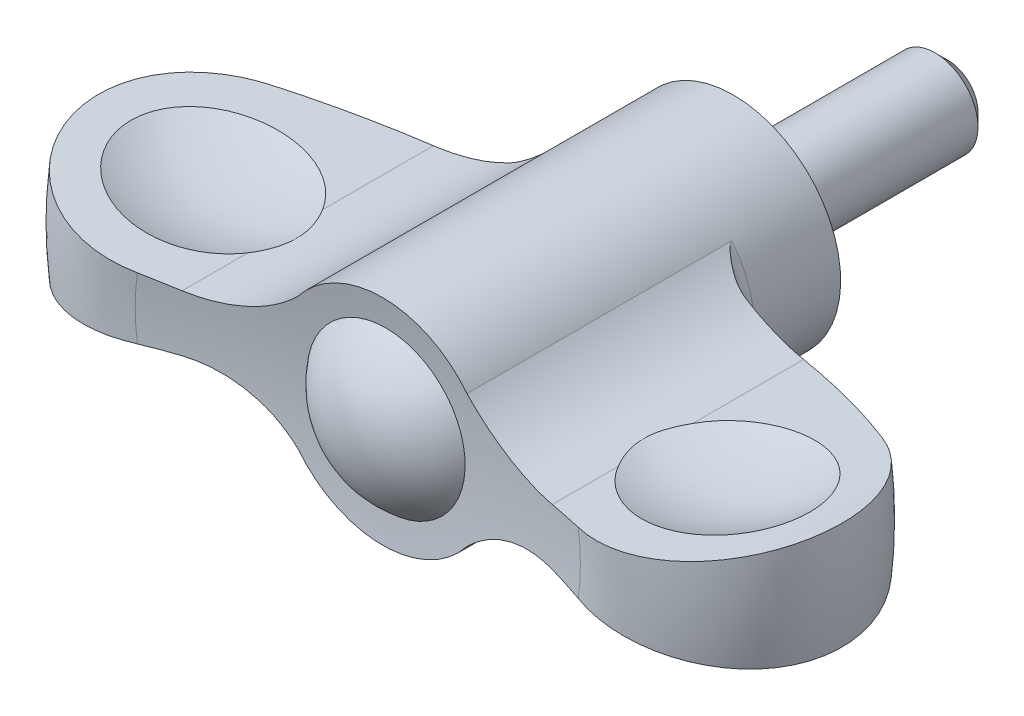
ISO-10303-21;
HEADER;
FILE_DESCRIPTION(('STEP AP214'),'2;1');
FILE_NAME('part.step','',(''),(''),'','','');
FILE_SCHEMA(('AUTOMOTIVE_DESIGN { 1 0 10303 214 1 1 1 1 }'));
ENDSEC;
DATA;
#1=APPLICATION_CONTEXT('core data for automotive mechanical design processes');
#2=APPLICATION_PROTOCOL_DEFINITION('international standard','automotive_design',2000,#1);
#3=PRODUCT_CONTEXT('',#1,'mechanical');
#4=PRODUCT('Part','Part','',(#3));
#5=PRODUCT_RELATED_PRODUCT_CATEGORY('part','',(#4));
#6=PRODUCT_DEFINITION_FORMATION('','',#4);
#7=PRODUCT_DEFINITION_CONTEXT('part definition',#1,'design');
#8=PRODUCT_DEFINITION('design','',#6,#7);
#9=PRODUCT_DEFINITION_SHAPE('','',#8);
#10=(LENGTH_UNIT() NAMED_UNIT(*) SI_UNIT(.MILLI.,.METRE.));
#11=(NAMED_UNIT(*) PLANE_ANGLE_UNIT() SI_UNIT($,.RADIAN.));
#12=(NAMED_UNIT(*) SI_UNIT($,.STERADIAN.) SOLID_ANGLE_UNIT());
#13=UNCERTAINTY_MEASURE_WITH_UNIT(LENGTH_MEASURE(1.E-05),#10,'distance_accuracy_value','');
#14=(GEOMETRIC_REPRESENTATION_CONTEXT(3) GLOBAL_UNCERTAINTY_ASSIGNED_CONTEXT((#13)) GLOBAL_UNIT_ASSIGNED_CONTEXT((#10,
#11,#12)) REPRESENTATION_CONTEXT('',''));
#15=CARTESIAN_POINT('',(0.,0.,0.));
#16=DIRECTION('',(0.,0.,1.));
#17=DIRECTION('',(1.,0.,0.));
#18=AXIS2_PLACEMENT_3D('',#15,#16,#17);
#19=CARTESIAN_POINT('',(0.,0.,8.));
#20=DIRECTION('',(0.,0.,-1.));
#21=DIRECTION('',(0.,1.,0.));
#22=AXIS2_PLACEMENT_3D('',#19,#20,#21);
#23=TOROIDAL_SURFACE('',#22,11.8,1.80000000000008);
#24=CARTESIAN_POINT('',(-10.936400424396,-3.94636818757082,9.7916319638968));
#25=CARTESIAN_POINT('',(-10.824118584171,-4.00370429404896,9.78325234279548));
#26=CARTESIAN_POINT('',(-10.7132133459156,-4.06254400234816,9.76897182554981));
#27=CARTESIAN_POINT('',(-10.4947965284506,-4.18269546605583,9.73031315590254));
#28=CARTESIAN_POINT('',(-10.3872790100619,-4.24400241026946,9.70595387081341));
#29=CARTESIAN_POINT('',(-10.1765147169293,-4.36838152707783,9.6489761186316));
#30=CARTESIAN_POINT('',(-10.0732455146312,-4.43144032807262,9.61641003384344));
#31=CARTESIAN_POINT('',(-9.87034998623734,-4.55941800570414,9.54423053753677));
#32=CARTESIAN_POINT('',(-9.77072514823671,-4.62433762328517,9.50461428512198));
#33=CARTESIAN_POINT('',(-9.55076497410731,-4.77218804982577,9.40879869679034));
#34=CARTESIAN_POINT('',(-9.43146470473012,-4.85557105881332,9.35092807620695));
#35=CARTESIAN_POINT('',(-9.19845422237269,-5.0245357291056,9.22749490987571));
#36=CARTESIAN_POINT('',(-9.08474708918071,-5.11011856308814,9.16192819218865));
#37=CARTESIAN_POINT('',(-8.89583509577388,-5.25740071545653,9.04459290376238));
#38=CARTESIAN_POINT('',(-8.81922141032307,-5.31864764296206,8.99450670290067));
#39=CARTESIAN_POINT('',(-8.66877804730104,-5.44185241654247,8.89113944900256));
#40=CARTESIAN_POINT('',(-8.59494804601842,-5.50381017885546,8.83785876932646));
#41=CARTESIAN_POINT('',(-8.4741799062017,-5.60755853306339,8.74594898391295));
#42=CARTESIAN_POINT('',(-8.42641392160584,-5.64925103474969,8.7082931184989));
#43=CARTESIAN_POINT('',(-8.33242521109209,-5.73256077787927,8.6310972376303));
#44=CARTESIAN_POINT('',(-8.28620142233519,-5.77417805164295,8.59155856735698));
#45=CARTESIAN_POINT('',(-8.21125367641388,-5.84266935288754,8.52388347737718));
#46=CARTESIAN_POINT('',(-8.18198002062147,-5.86968993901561,8.49650386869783));
#47=CARTESIAN_POINT('',(-8.12444979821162,-5.92330159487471,8.44010631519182));
#48=CARTESIAN_POINT('',(-8.09619524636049,-5.94989176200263,8.41108538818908));
#49=CARTESIAN_POINT('',(-8.04234032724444,-6.00103726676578,8.35179046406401));
#50=CARTESIAN_POINT('',(-8.01668026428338,-6.02563150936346,8.32160361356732));
#51=CARTESIAN_POINT('',(-7.96790958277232,-6.07276025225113,8.2576023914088));
#52=CARTESIAN_POINT('',(-7.94479257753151,-6.09529988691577,8.22379754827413));
#53=CARTESIAN_POINT('',(-7.91701322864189,-6.12255630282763,8.17250880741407));
#54=CARTESIAN_POINT('',(-7.90975258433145,-6.12970126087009,8.157793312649));
#55=CARTESIAN_POINT('',(-7.89665438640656,-6.14261741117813,8.12727584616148));
#56=CARTESIAN_POINT('',(-7.89080740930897,-6.14839769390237,8.11148202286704));
#57=CARTESIAN_POINT('',(-7.88158226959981,-6.15753000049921,8.08013275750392));
#58=CARTESIAN_POINT('',(-7.87802903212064,-6.16105398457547,8.06468423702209));
#59=CARTESIAN_POINT('',(-7.87307566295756,-6.16597001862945,8.03281428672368));
#60=CARTESIAN_POINT('',(-7.87172008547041,-6.16731795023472,8.01637956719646));
#61=CARTESIAN_POINT('',(-7.8717856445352,-6.16725149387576,7.9998));
#62=B_SPLINE_CURVE_WITH_KNOTS('',3,(#24,#25,#26,#27,#28,#29,#30,#31,#32,#33,#34,#35,#36,#37,#38,
#39,#40,#41,#42,#43,#44,#45,#46,#47,#48,#49,#50,#51,#52,#53,#54,#55,#56,#57,#58,#59,#60,#61),
.UNSPECIFIED.,.F.,.F.,(4,2,2,2,2,2,2,2,2,2,2,2,2,2,2,2,2,2,4),(0.,0.378686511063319,
0.756667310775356,1.13229407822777,1.50807255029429,1.97761636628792,2.44741590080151,
2.77774393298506,3.10803343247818,3.32923096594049,3.55027276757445,3.6952714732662,
3.84054267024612,3.98039395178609,4.11988557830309,4.17347981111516,4.22670627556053,
4.27513325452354,4.32453026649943),.UNSPECIFIED.);
#63=CARTESIAN_POINT('',(-10.9337221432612,-3.94773654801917,9.7914319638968));
#64=VERTEX_POINT('',#63);
#65=CARTESIAN_POINT('',(-7.8717855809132,-6.16725155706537,8.));
#66=VERTEX_POINT('',#65);
#67=EDGE_CURVE('E416',#64,#66,#62,.T.);
#68=ORIENTED_EDGE('',*,*,#67,.F.);
#69=CARTESIAN_POINT('',(0.,0.,9.7914319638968));
#70=DIRECTION('',(0.,0.,-1.));
#71=DIRECTION('',(0.,1.,0.));
#72=AXIS2_PLACEMENT_3D('',#69,#70,#71);
#73=CIRCLE('',#72,11.6245818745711);
#74=CARTESIAN_POINT('',(-10.9337221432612,3.94773654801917,9.7914319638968));
#75=VERTEX_POINT('',#74);
#76=EDGE_CURVE('E418',#64,#75,#73,.T.);
#77=ORIENTED_EDGE('',*,*,#76,.T.);
#78=CARTESIAN_POINT('',(-10.936400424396,3.94636818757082,9.7916319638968));
#79=CARTESIAN_POINT('',(-10.824118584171,4.00370429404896,9.78325234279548));
#80=CARTESIAN_POINT('',(-10.7132133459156,4.06254400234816,9.76897182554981));
#81=CARTESIAN_POINT('',(-10.4947965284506,4.18269546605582,9.73031315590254));
#82=CARTESIAN_POINT('',(-10.3872790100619,4.24400241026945,9.70595387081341));
#83=CARTESIAN_POINT('',(-10.1765147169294,4.36838152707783,9.64897611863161));
#84=CARTESIAN_POINT('',(-10.0732455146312,4.43144032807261,9.61641003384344));
#85=CARTESIAN_POINT('',(-9.87034998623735,4.55941800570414,9.54423053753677));
#86=CARTESIAN_POINT('',(-9.77072514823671,4.62433762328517,9.50461428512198));
#87=CARTESIAN_POINT('',(-9.55076497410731,4.77218804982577,9.40879869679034));
#88=CARTESIAN_POINT('',(-9.43146470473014,4.85557105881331,9.35092807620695));
#89=CARTESIAN_POINT('',(-9.1984542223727,5.02453572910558,9.22749490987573));
#90=CARTESIAN_POINT('',(-9.0847470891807,5.11011856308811,9.1619281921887));
#91=CARTESIAN_POINT('',(-8.89583509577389,5.25740071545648,9.04459290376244));
#92=CARTESIAN_POINT('',(-8.8192214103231,5.318647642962,8.99450670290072));
#93=CARTESIAN_POINT('',(-8.66877804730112,5.44185241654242,8.89113944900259));
#94=CARTESIAN_POINT('',(-8.59494804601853,5.50381017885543,8.8378587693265));
#95=CARTESIAN_POINT('',(-8.47417990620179,5.60755853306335,8.74594898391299));
#96=CARTESIAN_POINT('',(-8.4264139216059,5.64925103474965,8.70829311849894));
#97=CARTESIAN_POINT('',(-8.33242521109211,5.73256077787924,8.63109723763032));
#98=CARTESIAN_POINT('',(-8.2862014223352,5.77417805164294,8.59155856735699));
#99=CARTESIAN_POINT('',(-8.21125367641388,5.84266935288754,8.52388347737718));
#100=CARTESIAN_POINT('',(-8.18198002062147,5.86968993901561,8.49650386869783));
#101=CARTESIAN_POINT('',(-8.12444979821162,5.92330159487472,8.44010631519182));
#102=CARTESIAN_POINT('',(-8.09619524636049,5.94989176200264,8.41108538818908));
#103=CARTESIAN_POINT('',(-8.04234032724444,6.00103726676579,8.35179046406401));
#104=CARTESIAN_POINT('',(-8.01668026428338,6.02563150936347,8.32160361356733));
#105=CARTESIAN_POINT('',(-7.96790958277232,6.07276025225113,8.2576023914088));
#106=CARTESIAN_POINT('',(-7.94479257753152,6.09529988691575,8.22379754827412));
#107=CARTESIAN_POINT('',(-7.91701322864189,6.12255630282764,8.17250880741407));
#108=CARTESIAN_POINT('',(-7.90975258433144,6.1297012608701,8.15779331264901));
#109=CARTESIAN_POINT('',(-7.89665438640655,6.14261741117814,8.12727584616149));
#110=CARTESIAN_POINT('',(-7.89080740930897,6.14839769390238,8.11148202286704));
#111=CARTESIAN_POINT('',(-7.88158226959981,6.1575300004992,8.08013275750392));
#112=CARTESIAN_POINT('',(-7.87802903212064,6.16105398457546,8.06468423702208));
#113=CARTESIAN_POINT('',(-7.87307566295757,6.16597001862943,8.03281428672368));
#114=CARTESIAN_POINT('',(-7.87172008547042,6.16731795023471,8.01637956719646));
#115=CARTESIAN_POINT('',(-7.8717856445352,6.16725149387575,7.9998));
#116=B_SPLINE_CURVE_WITH_KNOTS('',3,(#78,#79,#80,#81,#82,#83,#84,#85,#86,#87,#88,#89,#90,#91,
#92,#93,#94,#95,#96,#97,#98,#99,#100,#101,#102,#103,#104,#105,#106,#107,#108,#109,#110,#111,
#112,#113,#114,#115),.UNSPECIFIED.,.F.,.F.,(4,2,2,2,2,2,2,2,2,2,2,2,2,2,2,2,2,2,4),(0.,
0.378686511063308,0.756667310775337,1.13229407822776,1.50807255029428,1.97761636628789,
2.44741590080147,2.77774393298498,3.10803343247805,3.32923096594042,3.55027276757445,
3.6952714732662,3.84054267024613,3.98039395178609,4.11988557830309,4.17347981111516,
4.22670627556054,4.27513325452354,4.32453026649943),.UNSPECIFIED.);
#117=CARTESIAN_POINT('',(-7.8717855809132,6.16725155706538,8.));
#118=VERTEX_POINT('',#117);
#119=EDGE_CURVE('E317',#75,#118,#116,.T.);
#120=ORIENTED_EDGE('',*,*,#119,.T.);
#121=CARTESIAN_POINT('',(0.,0.,8.));
#122=DIRECTION('',(0.,0.,-1.));
#123=DIRECTION('',(0.,1.,0.));
#124=AXIS2_PLACEMENT_3D('',#121,#122,#123);
#125=CIRCLE('',#124,10.);
#126=EDGE_CURVE('E420',#66,#118,#125,.T.);
#127=ORIENTED_EDGE('',*,*,#126,.F.);
#128=EDGE_LOOP('',(#68,#77,#120,#127));
#129=FACE_BOUND('',#128,.T.);
#130=ADVANCED_FACE('F14',(#129),#23,.F.);
#131=CARTESIAN_POINT('',(0.,0.,60.3122983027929));
#132=DIRECTION('',(0.,0.,-1.));
#133=DIRECTION('',(0.,1.,0.));
#134=AXIS2_PLACEMENT_3D('',#131,#132,#133);
#135=DEGENERATE_TOROIDAL_SURFACE('',#134,6.6775474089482,50.7624968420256,.T.);
#136=ORIENTED_EDGE('',*,*,#76,.F.);
#137=CARTESIAN_POINT('',(-6.5467060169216,-7.72330133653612,9.66697769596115));
#138=CARTESIAN_POINT('',(-6.64591288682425,-7.58492422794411,9.66416255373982));
#139=CARTESIAN_POINT('',(-6.74799440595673,-7.44862247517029,9.661900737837));
#140=CARTESIAN_POINT('',(-6.95774811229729,-7.18037757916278,9.65844214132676));
#141=CARTESIAN_POINT('',(-7.06542027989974,-7.04843442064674,9.6572453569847));
#142=CARTESIAN_POINT('',(-7.39653737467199,-6.6595102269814,9.65519040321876));
#143=CARTESIAN_POINT('',(-7.62812663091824,-6.40937348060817,9.65586643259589));
#144=CARTESIAN_POINT('',(-8.11129299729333,-5.92925394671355,9.66138002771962));
#145=CARTESIAN_POINT('',(-8.36287299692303,-5.69927408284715,9.66621819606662));
#146=CARTESIAN_POINT('',(-8.88421895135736,-5.26109545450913,9.68055080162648));
#147=CARTESIAN_POINT('',(-9.15398440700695,-5.05289609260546,9.69004511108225));
#148=CARTESIAN_POINT('',(-9.70731186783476,-4.66146851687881,9.71434109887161));
#149=CARTESIAN_POINT('',(-9.99073342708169,-4.47803881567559,9.72909588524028));
#150=CARTESIAN_POINT('',(-10.5714417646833,-4.13530031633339,9.76473262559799));
#151=CARTESIAN_POINT('',(-10.8687285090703,-3.97599145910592,9.78561456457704));
#152=CARTESIAN_POINT('',(-11.4746831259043,-3.68269992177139,9.83420440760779));
#153=CARTESIAN_POINT('',(-11.7833407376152,-3.54869504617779,9.86190627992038));
#154=CARTESIAN_POINT('',(-12.4099583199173,-3.30668939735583,9.92468529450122));
#155=CARTESIAN_POINT('',(-12.72791823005,-3.19868845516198,9.95976238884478));
#156=CARTESIAN_POINT('',(-13.3702784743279,-3.00943594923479,10.0375625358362));
#157=CARTESIAN_POINT('',(-13.694668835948,-2.92814595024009,10.080274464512));
#158=CARTESIAN_POINT('',(-14.3479208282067,-2.7924555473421,10.173495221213));
#159=CARTESIAN_POINT('',(-14.6767824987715,-2.73805538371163,10.2240041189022));
#160=CARTESIAN_POINT('',(-15.3369192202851,-2.65620760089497,10.3328061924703));
#161=CARTESIAN_POINT('',(-15.6681964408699,-2.62878831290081,10.3911074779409));
#162=CARTESIAN_POINT('',(-16.3304789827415,-2.60086726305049,10.5152293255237));
#163=CARTESIAN_POINT('',(-16.6614842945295,-2.60036640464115,10.5810501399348));
#164=CARTESIAN_POINT('',(-17.3240428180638,-2.62605289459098,10.7205107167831));
#165=CARTESIAN_POINT('',(-17.6555720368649,-2.65249066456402,10.7942180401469));
#166=CARTESIAN_POINT('',(-18.3138495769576,-2.73187573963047,10.9484805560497));
#167=CARTESIAN_POINT('',(-18.6405974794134,-2.78482535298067,11.0290363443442));
#168=CARTESIAN_POINT('',(-19.2867879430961,-2.91642655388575,11.1963521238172));
#169=CARTESIAN_POINT('',(-19.6062391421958,-2.99504586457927,11.2831042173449));
#170=CARTESIAN_POINT('',(-20.2362844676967,-3.17708996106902,11.4622866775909));
#171=CARTESIAN_POINT('',(-20.5468805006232,-3.28050936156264,11.5547158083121));
#172=CARTESIAN_POINT('',(-20.8521318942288,-3.39588894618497,11.6496949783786));
#173=B_SPLINE_CURVE_WITH_KNOTS('',3,(#137,#138,#139,#140,#141,#142,#143,#144,#145,#146,#147,
#148,#149,#150,#151,#152,#153,#154,#155,#156,#157,#158,#159,#160,#161,#162,#163,#164,#165,#166,
#167,#168,#169,#170,#171,#172),.UNSPECIFIED.,.F.,.F.,(4,2,2,2,2,2,2,2,2,2,2,2,2,2,2,2,2,4),(0.,
0.510785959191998,1.02157012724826,2.04291399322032,3.06440575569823,4.08586949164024,
5.09844663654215,6.11102130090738,7.12270361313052,8.13437935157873,9.14459291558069,
10.1548155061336,11.1660977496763,12.1774139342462,13.1982178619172,14.2191106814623,
15.2387247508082,16.2581176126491),.UNSPECIFIED.);
#174=CARTESIAN_POINT('',(-17.2513916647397,-2.62600423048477,10.7060191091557));
#175=VERTEX_POINT('',#174);
#176=EDGE_CURVE('E424',#64,#175,#173,.T.);
#177=ORIENTED_EDGE('',*,*,#176,.T.);
#178=CARTESIAN_POINT('',(-28.5420587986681,-3.86093353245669,14.6248916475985));
#179=CARTESIAN_POINT('',(-28.0949251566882,-3.78973654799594,14.4056959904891));
#180=CARTESIAN_POINT('',(-27.6441940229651,-3.72065339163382,14.1932196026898));
#181=CARTESIAN_POINT('',(-26.7359054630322,-3.58698745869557,13.7818878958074));
#182=CARTESIAN_POINT('',(-26.2783480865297,-3.52240464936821,13.583032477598));
#183=CARTESIAN_POINT('',(-24.8998297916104,-3.33633398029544,13.0087706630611));
#184=CARTESIAN_POINT('',(-23.9692804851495,-3.22192463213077,12.6538347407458));
#185=CARTESIAN_POINT('',(-22.0863023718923,-3.01405683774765,12.0002442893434));
#186=CARTESIAN_POINT('',(-21.133873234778,-2.92059870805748,11.701590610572));
#187=CARTESIAN_POINT('',(-19.6898454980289,-2.79722984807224,11.296179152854));
#188=CARTESIAN_POINT('',(-19.2049108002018,-2.75884755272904,11.1679139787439));
#189=CARTESIAN_POINT('',(-18.2309836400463,-2.68796520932,10.9259763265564));
#190=CARTESIAN_POINT('',(-17.7419911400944,-2.65546521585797,10.8123039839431));
#191=CARTESIAN_POINT('',(-17.2511916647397,-2.6259922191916,10.7059757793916));
#192=B_SPLINE_CURVE_WITH_KNOTS('',3,(#178,#179,#180,#181,#182,#183,#184,#185,#186,#187,#188,
#189,#190,#191),.UNSPECIFIED.,.F.,.F.,(4,2,2,2,2,2,4),(0.,1.50898291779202,3.01795485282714,
6.0232908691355,9.02867228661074,10.5376740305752,12.0466897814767),.UNSPECIFIED.);
#193=CARTESIAN_POINT('',(-28.5416508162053,-3.86086857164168,14.6246916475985));
#194=VERTEX_POINT('',#193);
#195=EDGE_CURVE('E506',#194,#175,#192,.T.);
#196=ORIENTED_EDGE('',*,*,#195,.F.);
#197=CARTESIAN_POINT('',(0.,0.,14.6246916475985));
#198=DIRECTION('',(0.,0.,-1.));
#199=DIRECTION('',(0.,1.,0.));
#200=AXIS2_PLACEMENT_3D('',#197,#198,#199);
#201=CIRCLE('',#200,28.8015995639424);
#202=CARTESIAN_POINT('',(-28.5416508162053,3.86086857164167,14.6246916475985));
#203=VERTEX_POINT('',#202);
#204=EDGE_CURVE('E434',#194,#203,#201,.T.);
#205=ORIENTED_EDGE('',*,*,#204,.T.);
#206=CARTESIAN_POINT('',(-28.542058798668,3.86093353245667,14.6248916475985));
#207=CARTESIAN_POINT('',(-28.0949251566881,3.78973654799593,14.4056959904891));
#208=CARTESIAN_POINT('',(-27.644194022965,3.7206533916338,14.1932196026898));
#209=CARTESIAN_POINT('',(-26.7359054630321,3.58698745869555,13.7818878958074));
#210=CARTESIAN_POINT('',(-26.2783480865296,3.52240464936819,13.583032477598));
#211=CARTESIAN_POINT('',(-24.8998297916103,3.33633398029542,13.0087706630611));
#212=CARTESIAN_POINT('',(-23.9692804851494,3.22192463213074,12.6538347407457));
#213=CARTESIAN_POINT('',(-22.0863023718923,3.01405683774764,12.0002442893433));
#214=CARTESIAN_POINT('',(-21.133873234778,2.92059870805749,11.701590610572));
#215=CARTESIAN_POINT('',(-19.6898454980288,2.79722984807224,11.296179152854));
#216=CARTESIAN_POINT('',(-19.2049108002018,2.75884755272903,11.1679139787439));
#217=CARTESIAN_POINT('',(-18.2309836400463,2.68796520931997,10.9259763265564));
#218=CARTESIAN_POINT('',(-17.7419911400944,2.65546521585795,10.8123039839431));
#219=CARTESIAN_POINT('',(-17.2511916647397,2.6259922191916,10.7059757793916));
#220=B_SPLINE_CURVE_WITH_KNOTS('',3,(#206,#207,#208,#209,#210,#211,#212,#213,#214,#215,#216,
#217,#218,#219),.UNSPECIFIED.,.F.,.F.,(4,2,2,2,2,2,4),(0.,1.50898291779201,3.01795485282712,
6.02329086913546,9.02867228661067,10.5376740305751,12.0466897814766),.UNSPECIFIED.);
#221=CARTESIAN_POINT('',(-17.2513916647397,2.62600423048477,10.7060191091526));
#222=VERTEX_POINT('',#221);
#223=EDGE_CURVE('E331',#203,#222,#220,.T.);
#224=ORIENTED_EDGE('',*,*,#223,.T.);
#225=CARTESIAN_POINT('',(-6.5467060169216,7.72330133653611,9.66697769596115));
#226=CARTESIAN_POINT('',(-6.64591288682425,7.5849242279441,9.66416255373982));
#227=CARTESIAN_POINT('',(-6.74799440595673,7.44862247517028,9.661900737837));
#228=CARTESIAN_POINT('',(-6.9577481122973,7.18037757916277,9.65844214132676));
#229=CARTESIAN_POINT('',(-7.06542027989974,7.04843442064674,9.6572453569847));
#230=CARTESIAN_POINT('',(-7.39653737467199,6.65951022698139,9.65519040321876));
#231=CARTESIAN_POINT('',(-7.62812663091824,6.40937348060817,9.65586643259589));
#232=CARTESIAN_POINT('',(-8.11129299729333,5.92925394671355,9.66138002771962));
#233=CARTESIAN_POINT('',(-8.36287299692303,5.69927408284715,9.66621819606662));
#234=CARTESIAN_POINT('',(-8.88421895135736,5.26109545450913,9.68055080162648));
#235=CARTESIAN_POINT('',(-9.15398440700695,5.05289609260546,9.69004511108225));
#236=CARTESIAN_POINT('',(-9.70731186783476,4.66146851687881,9.71434109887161));
#237=CARTESIAN_POINT('',(-9.99073342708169,4.47803881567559,9.72909588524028));
#238=CARTESIAN_POINT('',(-10.5714417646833,4.13530031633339,9.76473262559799));
#239=CARTESIAN_POINT('',(-10.8687285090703,3.97599145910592,9.78561456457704));
#240=CARTESIAN_POINT('',(-11.4746831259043,3.68269992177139,9.83420440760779));
#241=CARTESIAN_POINT('',(-11.7833407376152,3.54869504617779,9.86190627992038));
#242=CARTESIAN_POINT('',(-12.4099583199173,3.30668939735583,9.92468529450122));
#243=CARTESIAN_POINT('',(-12.72791823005,3.19868845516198,9.95976238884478));
#244=CARTESIAN_POINT('',(-13.3702784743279,3.00943594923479,10.0375625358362));
#245=CARTESIAN_POINT('',(-13.694668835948,2.92814595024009,10.080274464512));
#246=CARTESIAN_POINT('',(-14.3479208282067,2.7924555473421,10.173495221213));
#247=CARTESIAN_POINT('',(-14.6767824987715,2.73805538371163,10.2240041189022));
#248=CARTESIAN_POINT('',(-15.3369192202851,2.65620760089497,10.3328061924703));
#249=CARTESIAN_POINT('',(-15.6681964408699,2.62878831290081,10.3911074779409));
#250=CARTESIAN_POINT('',(-16.3304789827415,2.60086726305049,10.5152293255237));
#251=CARTESIAN_POINT('',(-16.6614842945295,2.60036640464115,10.5810501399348));
#252=CARTESIAN_POINT('',(-17.3240428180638,2.62605289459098,10.7205107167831));
#253=CARTESIAN_POINT('',(-17.6555720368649,2.65249066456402,10.7942180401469));
#254=CARTESIAN_POINT('',(-18.3138495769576,2.73187573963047,10.9484805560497));
#255=CARTESIAN_POINT('',(-18.6405974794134,2.78482535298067,11.0290363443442));
#256=CARTESIAN_POINT('',(-19.2867879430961,2.91642655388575,11.1963521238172));
#257=CARTESIAN_POINT('',(-19.6062391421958,2.99504586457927,11.2831042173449));
#258=CARTESIAN_POINT('',(-20.2362844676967,3.17708996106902,11.4622866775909));
#259=CARTESIAN_POINT('',(-20.5468805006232,3.28050936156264,11.5547158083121));
#260=CARTESIAN_POINT('',(-20.8521318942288,3.39588894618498,11.6496949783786));
#261=B_SPLINE_CURVE_WITH_KNOTS('',3,(#225,#226,#227,#228,#229,#230,#231,#232,#233,#234,#235,
#236,#237,#238,#239,#240,#241,#242,#243,#244,#245,#246,#247,#248,#249,#250,#251,#252,#253,#254,
#255,#256,#257,#258,#259,#260),.UNSPECIFIED.,.F.,.F.,(4,2,2,2,2,2,2,2,2,2,2,2,2,2,2,2,2,4),(0.,
0.510785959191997,1.02157012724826,2.04291399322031,3.06440575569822,4.08586949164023,
5.09844663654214,6.11102130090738,7.12270361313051,8.13437935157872,9.14459291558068,
10.1548155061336,11.1660977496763,12.1774139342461,13.1982178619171,14.2191106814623,
15.2387247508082,16.2581176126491),.UNSPECIFIED.);
#262=EDGE_CURVE('E300',#75,#222,#261,.T.);
#263=ORIENTED_EDGE('',*,*,#262,.F.);
#264=EDGE_LOOP('',(#136,#177,#196,#205,#224,#263));
#265=FACE_BOUND('',#264,.T.);
#266=ADVANCED_FACE('F406',(#265),#135,.T.);
#267=CARTESIAN_POINT('',(0.,0.,24.5131504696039));
#268=DIRECTION('',(0.,0.,-1.));
#269=DIRECTION('',(0.,1.,0.));
#270=AXIS2_PLACEMENT_3D('',#267,#268,#269);
#271=TOROIDAL_SURFACE('',#270,24.0131504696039,10.9868495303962);
#272=CARTESIAN_POINT('',(-17.2511916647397,-2.62599221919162,33.3242100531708));
#273=CARTESIAN_POINT('',(-17.4993781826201,-2.64089075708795,33.5086851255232));
#274=CARTESIAN_POINT('',(-17.7552628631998,-2.65706460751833,33.6826969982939));
#275=CARTESIAN_POINT('',(-18.28053769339,-2.69210530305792,34.0086627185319));
#276=CARTESIAN_POINT('',(-18.5499277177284,-2.71097212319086,34.1606167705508));
#277=CARTESIAN_POINT('',(-19.1002002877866,-2.75153205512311,34.4412740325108));
#278=CARTESIAN_POINT('',(-19.381077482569,-2.77322386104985,34.5699879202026));
#279=CARTESIAN_POINT('',(-19.952432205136,-2.81952002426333,34.8033129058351));
#280=CARTESIAN_POINT('',(-20.2429095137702,-2.84412431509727,34.9079245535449));
#281=CARTESIAN_POINT('',(-20.8315983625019,-2.89628797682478,35.0923323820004));
#282=CARTESIAN_POINT('',(-21.1298150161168,-2.92384934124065,35.1721116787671));
#283=CARTESIAN_POINT('',(-21.7316508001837,-2.98187199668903,35.3061577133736));
#284=CARTESIAN_POINT('',(-22.035269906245,-3.01233327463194,35.3604245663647));
#285=CARTESIAN_POINT('',(-22.6456357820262,-3.0760359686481,35.4430189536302));
#286=CARTESIAN_POINT('',(-22.9523815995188,-3.10927655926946,35.4713541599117));
#287=CARTESIAN_POINT('',(-23.566877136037,-3.17836345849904,35.501889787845));
#288=CARTESIAN_POINT('',(-23.874626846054,-3.21420974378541,35.504090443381));
#289=CARTESIAN_POINT('',(-24.4874432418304,-3.28807700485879,35.4823817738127));
#290=CARTESIAN_POINT('',(-24.7925157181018,-3.32608674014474,35.4585974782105));
#291=CARTESIAN_POINT('',(-25.3992908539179,-3.404117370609,35.3852808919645));
#292=CARTESIAN_POINT('',(-25.7009935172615,-3.44413826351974,35.3357486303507));
#293=CARTESIAN_POINT('',(-26.2989412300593,-3.52581537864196,35.211278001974));
#294=CARTESIAN_POINT('',(-26.595185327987,-3.56747188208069,35.1363352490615));
#295=CARTESIAN_POINT('',(-27.1800717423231,-3.65197221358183,34.9615826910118));
#296=CARTESIAN_POINT('',(-27.4687140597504,-3.69481604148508,34.8617728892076));
#297=CARTESIAN_POINT('',(-28.035952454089,-3.78113479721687,34.6381665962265));
#298=CARTESIAN_POINT('',(-28.3145627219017,-3.82460870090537,34.514405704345));
#299=CARTESIAN_POINT('',(-28.8602471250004,-3.9117173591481,34.2436848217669));
#300=CARTESIAN_POINT('',(-29.1273212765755,-3.9553521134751,34.0967248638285));
#301=CARTESIAN_POINT('',(-29.6480727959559,-4.04221651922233,33.7806574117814));
#302=CARTESIAN_POINT('',(-29.9017509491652,-4.08544619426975,33.6115512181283));
#303=CARTESIAN_POINT('',(-30.3939845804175,-4.17091924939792,33.2523788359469));
#304=CARTESIAN_POINT('',(-30.6325400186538,-4.21316262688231,33.0623125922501));
#305=CARTESIAN_POINT('',(-31.0935716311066,-4.29619199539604,32.6619711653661));
#306=CARTESIAN_POINT('',(-31.3159985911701,-4.33697334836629,32.4516383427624));
#307=CARTESIAN_POINT('',(-31.7424740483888,-4.41635307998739,32.0127202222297));
#308=CARTESIAN_POINT('',(-31.9465225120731,-4.45495145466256,31.7841348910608));
#309=CARTESIAN_POINT('',(-32.3348520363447,-4.5293877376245,31.3103146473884));
#310=CARTESIAN_POINT('',(-32.5191323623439,-4.56522554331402,31.0650791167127));
#311=CARTESIAN_POINT('',(-32.8666572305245,-4.63358841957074,30.5596945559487));
#312=CARTESIAN_POINT('',(-33.0299017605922,-4.66611348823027,30.2995455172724));
#313=CARTESIAN_POINT('',(-33.3345075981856,-4.72739462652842,29.7656976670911));
#314=CARTESIAN_POINT('',(-33.4758297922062,-4.75614394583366,29.4919757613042));
#315=CARTESIAN_POINT('',(-33.7352733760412,-4.80934524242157,28.9333467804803));
#316=CARTESIAN_POINT('',(-33.8533947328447,-4.83379721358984,28.6484396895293));
#317=CARTESIAN_POINT('',(-34.0656204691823,-4.87800530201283,28.0694731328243));
#318=CARTESIAN_POINT('',(-34.1597255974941,-4.89776156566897,27.7754139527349));
#319=CARTESIAN_POINT('',(-34.3232748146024,-4.93225390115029,27.180228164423));
#320=CARTESIAN_POINT('',(-34.3927189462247,-4.94698998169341,26.8791015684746));
#321=CARTESIAN_POINT('',(-34.5063857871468,-4.97117989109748,26.2723608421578));
#322=CARTESIAN_POINT('',(-34.5506442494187,-4.98064120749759,25.96675370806));
#323=CARTESIAN_POINT('',(-34.6137870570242,-4.99415603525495,25.3528106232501));
#324=CARTESIAN_POINT('',(-34.6326714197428,-4.99820955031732,25.0444746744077));
#325=CARTESIAN_POINT('',(-34.644935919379,-5.00084099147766,24.4272603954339));
#326=CARTESIAN_POINT('',(-34.6383150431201,-4.99941870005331,24.1183820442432));
#327=CARTESIAN_POINT('',(-34.5996125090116,-4.9911218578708,23.5022985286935));
#328=CARTESIAN_POINT('',(-34.5675308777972,-4.9842473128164,23.1950933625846));
#329=CARTESIAN_POINT('',(-34.4781950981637,-4.96517513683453,22.5850017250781));
#330=CARTESIAN_POINT('',(-34.4209785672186,-4.95298546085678,22.2821094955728));
#331=CARTESIAN_POINT('',(-34.2817747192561,-4.92348679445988,21.6823260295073));
#332=CARTESIAN_POINT('',(-34.1997873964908,-4.90617780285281,21.3854347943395));
#333=CARTESIAN_POINT('',(-34.0116119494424,-4.86672680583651,20.799780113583));
#334=CARTESIAN_POINT('',(-33.9054257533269,-4.84458518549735,20.5110160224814));
#335=CARTESIAN_POINT('',(-33.6695763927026,-4.79582854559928,19.9436331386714));
#336=CARTESIAN_POINT('',(-33.5399133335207,-4.76921354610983,19.6650143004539));
#337=CARTESIAN_POINT('',(-33.2578321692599,-4.71190410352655,19.1195687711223));
#338=CARTESIAN_POINT('',(-33.1053878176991,-4.68120495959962,18.8527561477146));
#339=CARTESIAN_POINT('',(-32.7788934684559,-4.61623623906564,18.3331441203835));
#340=CARTESIAN_POINT('',(-32.6048429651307,-4.58196657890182,18.0803450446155));
#341=CARTESIAN_POINT('',(-32.2363296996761,-4.51038975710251,17.5905487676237));
#342=CARTESIAN_POINT('',(-32.0418667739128,-4.47308257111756,17.3535516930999));
#343=CARTESIAN_POINT('',(-31.633867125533,-4.39599896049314,16.8970435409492));
#344=CARTESIAN_POINT('',(-31.4203320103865,-4.35622274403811,16.6775309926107));
#345=CARTESIAN_POINT('',(-31.0011481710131,-4.27945832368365,16.2816097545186));
#346=CARTESIAN_POINT('',(-30.797399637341,-4.24267293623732,16.103144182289));
#347=CARTESIAN_POINT('',(-30.377205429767,-4.16804353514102,15.7621159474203));
#348=CARTESIAN_POINT('',(-30.1607608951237,-4.13019961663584,15.5995518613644));
#349=CARTESIAN_POINT('',(-29.7163820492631,-4.05387450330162,15.2912603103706));
#350=CARTESIAN_POINT('',(-29.4884504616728,-4.01539346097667,15.1455288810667));
#351=CARTESIAN_POINT('',(-29.0222683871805,-3.9381829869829,14.871631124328));
#352=CARTESIAN_POINT('',(-28.7840165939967,-3.89945352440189,14.7434670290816));
#353=CARTESIAN_POINT('',(-28.5412428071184,-3.86080360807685,14.6244916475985));
#354=B_SPLINE_CURVE_WITH_KNOTS('',3,(#272,#273,#274,#275,#276,#277,#278,#279,#280,#281,#282,
#283,#284,#285,#286,#287,#288,#289,#290,#291,#292,#293,#294,#295,#296,#297,#298,#299,#300,#301,
#302,#303,#304,#305,#306,#307,#308,#309,#310,#311,#312,#313,#314,#315,#316,#317,#318,#319,#320,
#321,#322,#323,#324,#325,#326,#327,#328,#329,#330,#331,#332,#333,#334,#335,#336,#337,#338,#339,
#340,#341,#342,#343,#344,#345,#346,#347,#348,#349,#350,#351,#352,#353),.UNSPECIFIED.,.F.,.F.,(4,
2,2,2,2,2,2,2,2,2,2,2,2,2,2,2,2,2,2,2,2,2,2,2,2,2,2,2,2,2,2,2,2,2,2,2,2,2,2,2,4),(0.,
0.928513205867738,1.85701780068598,2.7850947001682,3.7131504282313,4.64183578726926,
5.57051695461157,6.49892327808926,7.42732129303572,8.35127181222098,9.27522128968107,
10.1993303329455,11.1234392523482,12.0461850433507,12.9689295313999,13.8916198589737,
14.8143126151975,15.7397117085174,16.6651124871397,17.5905476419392,18.5159833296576,
19.4430516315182,20.3701212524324,21.2971619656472,22.2242010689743,23.1499208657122,
24.0756400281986,25.0013959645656,25.9271509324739,26.8515250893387,27.7758994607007,
28.7002002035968,29.6244967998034,30.5498666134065,31.4752580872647,32.4006569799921,
33.3259779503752,34.1452666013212,34.9644818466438,35.7835037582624,36.6026296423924),.UNSPECIFIED.);
#355=CARTESIAN_POINT('',(-20.5453214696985,-2.87092129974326,35.0026521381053));
#356=VERTEX_POINT('',#355);
#357=EDGE_CURVE('E497',#356,#194,#354,.T.);
#358=ORIENTED_EDGE('',*,*,#357,.F.);
#359=CARTESIAN_POINT('',(0.,0.,35.0026521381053));
#360=DIRECTION('',(0.,0.,-1.));
#361=DIRECTION('',(0.,1.,0.));
#362=AXIS2_PLACEMENT_3D('',#359,#360,#361);
#363=CIRCLE('',#362,20.7449372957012);
#364=CARTESIAN_POINT('',(-20.5453214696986,2.87092129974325,35.0026521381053));
#365=VERTEX_POINT('',#364);
#366=EDGE_CURVE('E487',#356,#365,#363,.T.);
#367=ORIENTED_EDGE('',*,*,#366,.T.);
#368=CARTESIAN_POINT('',(-17.2511916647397,2.6259922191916,33.3242100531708));
#369=CARTESIAN_POINT('',(-17.4993781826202,2.64089075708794,33.5086851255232));
#370=CARTESIAN_POINT('',(-17.7552628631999,2.65706460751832,33.6826969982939));
#371=CARTESIAN_POINT('',(-18.28053769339,2.69210530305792,34.0086627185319));
#372=CARTESIAN_POINT('',(-18.5499277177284,2.71097212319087,34.1606167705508));
#373=CARTESIAN_POINT('',(-19.1002002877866,2.75153205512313,34.4412740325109));
#374=CARTESIAN_POINT('',(-19.3810774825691,2.77322386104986,34.5699879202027));
#375=CARTESIAN_POINT('',(-19.952432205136,2.81952002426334,34.8033129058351));
#376=CARTESIAN_POINT('',(-20.2429095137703,2.84412431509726,34.9079245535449));
#377=CARTESIAN_POINT('',(-20.831598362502,2.89628797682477,35.0923323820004));
#378=CARTESIAN_POINT('',(-21.1298150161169,2.92384934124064,35.1721116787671));
#379=CARTESIAN_POINT('',(-21.7316508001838,2.98187199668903,35.3061577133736));
#380=CARTESIAN_POINT('',(-22.0352699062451,3.01233327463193,35.3604245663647));
#381=CARTESIAN_POINT('',(-22.6456357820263,3.0760359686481,35.4430189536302));
#382=CARTESIAN_POINT('',(-22.9523815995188,3.10927655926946,35.4713541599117));
#383=CARTESIAN_POINT('',(-23.566877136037,3.17836345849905,35.501889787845));
#384=CARTESIAN_POINT('',(-23.874626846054,3.21420974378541,35.504090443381));
#385=CARTESIAN_POINT('',(-24.4874432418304,3.28807700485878,35.4823817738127));
#386=CARTESIAN_POINT('',(-24.7925157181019,3.32608674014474,35.4585974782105));
#387=CARTESIAN_POINT('',(-25.3992908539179,3.404117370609,35.3852808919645));
#388=CARTESIAN_POINT('',(-25.7009935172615,3.44413826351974,35.3357486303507));
#389=CARTESIAN_POINT('',(-26.2989412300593,3.52581537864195,35.211278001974));
#390=CARTESIAN_POINT('',(-26.595185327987,3.56747188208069,35.1363352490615));
#391=CARTESIAN_POINT('',(-27.1800717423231,3.65197221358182,34.9615826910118));
#392=CARTESIAN_POINT('',(-27.4687140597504,3.69481604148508,34.8617728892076));
#393=CARTESIAN_POINT('',(-28.035952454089,3.78113479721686,34.6381665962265));
#394=CARTESIAN_POINT('',(-28.3145627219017,3.82460870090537,34.514405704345));
#395=CARTESIAN_POINT('',(-28.8602471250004,3.9117173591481,34.2436848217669));
#396=CARTESIAN_POINT('',(-29.1273212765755,3.9553521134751,34.0967248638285));
#397=CARTESIAN_POINT('',(-29.6480727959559,4.04221651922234,33.7806574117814));
#398=CARTESIAN_POINT('',(-29.9017509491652,4.08544619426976,33.6115512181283));
#399=CARTESIAN_POINT('',(-30.3939845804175,4.17091924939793,33.2523788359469));
#400=CARTESIAN_POINT('',(-30.6325400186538,4.21316262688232,33.0623125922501));
#401=CARTESIAN_POINT('',(-31.0935716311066,4.29619199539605,32.6619711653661));
#402=CARTESIAN_POINT('',(-31.3159985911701,4.33697334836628,32.4516383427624));
#403=CARTESIAN_POINT('',(-31.7424740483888,4.41635307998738,32.0127202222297));
#404=CARTESIAN_POINT('',(-31.9465225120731,4.45495145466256,31.7841348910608));
#405=CARTESIAN_POINT('',(-32.3348520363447,4.52938773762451,31.3103146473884));
#406=CARTESIAN_POINT('',(-32.5191323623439,4.56522554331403,31.0650791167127));
#407=CARTESIAN_POINT('',(-32.8666572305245,4.63358841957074,30.5596945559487));
#408=CARTESIAN_POINT('',(-33.0299017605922,4.66611348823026,30.2995455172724));
#409=CARTESIAN_POINT('',(-33.3345075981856,4.72739462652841,29.7656976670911));
#410=CARTESIAN_POINT('',(-33.4758297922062,4.75614394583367,29.4919757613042));
#411=CARTESIAN_POINT('',(-33.7352733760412,4.80934524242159,28.9333467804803));
#412=CARTESIAN_POINT('',(-33.8533947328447,4.83379721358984,28.6484396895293));
#413=CARTESIAN_POINT('',(-34.0656204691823,4.87800530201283,28.0694731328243));
#414=CARTESIAN_POINT('',(-34.1597255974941,4.89776156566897,27.7754139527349));
#415=CARTESIAN_POINT('',(-34.3232748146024,4.93225390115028,27.180228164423));
#416=CARTESIAN_POINT('',(-34.3927189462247,4.9469899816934,26.8791015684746));
#417=CARTESIAN_POINT('',(-34.5063857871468,4.97117989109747,26.2723608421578));
#418=CARTESIAN_POINT('',(-34.5506442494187,4.9806412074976,25.96675370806));
#419=CARTESIAN_POINT('',(-34.6137870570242,4.99415603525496,25.3528106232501));
#420=CARTESIAN_POINT('',(-34.6326714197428,4.99820955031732,25.0444746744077));
#421=CARTESIAN_POINT('',(-34.644935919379,5.00084099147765,24.4272603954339));
#422=CARTESIAN_POINT('',(-34.6383150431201,4.9994187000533,24.1183820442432));
#423=CARTESIAN_POINT('',(-34.5996125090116,4.99112185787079,23.5022985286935));
#424=CARTESIAN_POINT('',(-34.5675308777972,4.98424731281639,23.1950933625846));
#425=CARTESIAN_POINT('',(-34.4781950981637,4.96517513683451,22.5850017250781));
#426=CARTESIAN_POINT('',(-34.4209785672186,4.95298546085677,22.2821094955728));
#427=CARTESIAN_POINT('',(-34.2817747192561,4.92348679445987,21.6823260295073));
#428=CARTESIAN_POINT('',(-34.1997873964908,4.90617780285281,21.3854347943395));
#429=CARTESIAN_POINT('',(-34.0116119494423,4.86672680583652,20.7997801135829));
#430=CARTESIAN_POINT('',(-33.9054257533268,4.84458518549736,20.5110160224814));
#431=CARTESIAN_POINT('',(-33.6695763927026,4.79582854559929,19.9436331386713));
#432=CARTESIAN_POINT('',(-33.5399133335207,4.76921354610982,19.6650143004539));
#433=CARTESIAN_POINT('',(-33.2578321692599,4.71190410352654,19.1195687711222));
#434=CARTESIAN_POINT('',(-33.1053878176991,4.68120495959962,18.8527561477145));
#435=CARTESIAN_POINT('',(-32.7788934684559,4.61623623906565,18.3331441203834));
#436=CARTESIAN_POINT('',(-32.6048429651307,4.58196657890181,18.0803450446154));
#437=CARTESIAN_POINT('',(-32.2363296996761,4.5103897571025,17.5905487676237));
#438=CARTESIAN_POINT('',(-32.0418667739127,4.47308257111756,17.3535516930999));
#439=CARTESIAN_POINT('',(-31.633867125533,4.39599896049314,16.8970435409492));
#440=CARTESIAN_POINT('',(-31.4203320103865,4.3562227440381,16.6775309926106));
#441=CARTESIAN_POINT('',(-31.0011481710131,4.27945832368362,16.2816097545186));
#442=CARTESIAN_POINT('',(-30.797399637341,4.2426729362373,16.103144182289));
#443=CARTESIAN_POINT('',(-30.377205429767,4.16804353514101,15.7621159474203));
#444=CARTESIAN_POINT('',(-30.1607608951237,4.13019961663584,15.5995518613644));
#445=CARTESIAN_POINT('',(-29.7163820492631,4.05387450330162,15.2912603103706));
#446=CARTESIAN_POINT('',(-29.4884504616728,4.01539346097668,15.1455288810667));
#447=CARTESIAN_POINT('',(-29.0222683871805,3.93818298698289,14.871631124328));
#448=CARTESIAN_POINT('',(-28.7840165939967,3.89945352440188,14.7434670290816));
#449=CARTESIAN_POINT('',(-28.5412428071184,3.86080360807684,14.6244916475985));
#450=B_SPLINE_CURVE_WITH_KNOTS('',3,(#368,#369,#370,#371,#372,#373,#374,#375,#376,#377,#378,
#379,#380,#381,#382,#383,#384,#385,#386,#387,#388,#389,#390,#391,#392,#393,#394,#395,#396,#397,
#398,#399,#400,#401,#402,#403,#404,#405,#406,#407,#408,#409,#410,#411,#412,#413,#414,#415,#416,
#417,#418,#419,#420,#421,#422,#423,#424,#425,#426,#427,#428,#429,#430,#431,#432,#433,#434,#435,
#436,#437,#438,#439,#440,#441,#442,#443,#444,#445,#446,#447,#448,#449),.UNSPECIFIED.,.F.,.F.,(4,
2,2,2,2,2,2,2,2,2,2,2,2,2,2,2,2,2,2,2,2,2,2,2,2,2,2,2,2,2,2,2,2,2,2,2,2,2,2,2,4),(0.,
0.92851320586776,1.85701780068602,2.78509470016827,3.7131504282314,4.64183578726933,
5.57051695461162,6.49892327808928,7.42732129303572,8.35127181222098,9.27522128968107,
10.1993303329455,11.1234392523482,12.0461850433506,12.9689295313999,13.8916198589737,
14.8143126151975,15.7397117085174,16.6651124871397,17.5905476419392,18.5159833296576,
19.4430516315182,20.3701212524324,21.2971619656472,22.2242010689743,23.1499208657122,
24.0756400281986,25.0013959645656,25.9271509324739,26.8515250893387,27.7758994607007,
28.7002002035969,29.6244967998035,30.5498666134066,31.4752580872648,32.4006569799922,
33.3259779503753,34.1452666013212,34.9644818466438,35.7835037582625,36.6026296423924),.UNSPECIFIED.);
#451=EDGE_CURVE('E324',#365,#203,#450,.T.);
#452=ORIENTED_EDGE('',*,*,#451,.T.);
#453=ORIENTED_EDGE('',*,*,#204,.F.);
#454=EDGE_LOOP('',(#358,#367,#452,#453));
#455=FACE_BOUND('',#454,.T.);
#456=ADVANCED_FACE('F337',(#455),#271,.T.);
#457=CARTESIAN_POINT('',(17.2511916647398,2.6259922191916,33.3242100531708));
#458=CARTESIAN_POINT('',(17.4993781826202,2.64089075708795,33.5086851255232));
#459=CARTESIAN_POINT('',(17.7552628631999,2.65706460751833,33.6826969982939));
#460=CARTESIAN_POINT('',(18.28053769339,2.69210530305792,34.0086627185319));
#461=CARTESIAN_POINT('',(18.5499277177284,2.71097212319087,34.1606167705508));
#462=CARTESIAN_POINT('',(19.1002002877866,2.75153205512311,34.4412740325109));
#463=CARTESIAN_POINT('',(19.3810774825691,2.77322386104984,34.5699879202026));
#464=CARTESIAN_POINT('',(19.952432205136,2.81952002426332,34.8033129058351));
#465=CARTESIAN_POINT('',(20.2429095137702,2.84412431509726,34.9079245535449));
#466=CARTESIAN_POINT('',(20.8315983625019,2.89628797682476,35.0923323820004));
#467=CARTESIAN_POINT('',(21.1298150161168,2.92384934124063,35.1721116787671));
#468=CARTESIAN_POINT('',(21.7316508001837,2.98187199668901,35.3061577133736));
#469=CARTESIAN_POINT('',(22.035269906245,3.01233327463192,35.3604245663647));
#470=CARTESIAN_POINT('',(22.6456357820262,3.07603596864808,35.4430189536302));
#471=CARTESIAN_POINT('',(22.9523815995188,3.10927655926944,35.4713541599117));
#472=CARTESIAN_POINT('',(23.566877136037,3.17836345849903,35.501889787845));
#473=CARTESIAN_POINT('',(23.874626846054,3.21420974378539,35.504090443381));
#474=CARTESIAN_POINT('',(24.4874432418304,3.28807700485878,35.4823817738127));
#475=CARTESIAN_POINT('',(24.7925157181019,3.32608674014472,35.4585974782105));
#476=CARTESIAN_POINT('',(25.3992908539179,3.40411737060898,35.3852808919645));
#477=CARTESIAN_POINT('',(25.7009935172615,3.44413826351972,35.3357486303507));
#478=CARTESIAN_POINT('',(26.2989412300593,3.52581537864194,35.211278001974));
#479=CARTESIAN_POINT('',(26.595185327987,3.56747188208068,35.1363352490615));
#480=CARTESIAN_POINT('',(27.1800717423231,3.65197221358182,34.9615826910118));
#481=CARTESIAN_POINT('',(27.4687140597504,3.69481604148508,34.8617728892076));
#482=CARTESIAN_POINT('',(28.035952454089,3.78113479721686,34.6381665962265));
#483=CARTESIAN_POINT('',(28.3145627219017,3.82460870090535,34.514405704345));
#484=CARTESIAN_POINT('',(28.8602471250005,3.91171735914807,34.2436848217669));
#485=CARTESIAN_POINT('',(29.1273212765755,3.95535211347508,34.0967248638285));
#486=CARTESIAN_POINT('',(29.6480727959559,4.04221651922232,33.7806574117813));
#487=CARTESIAN_POINT('',(29.9017509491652,4.08544619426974,33.6115512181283));
#488=CARTESIAN_POINT('',(30.3939845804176,4.17091924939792,33.2523788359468));
#489=CARTESIAN_POINT('',(30.6325400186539,4.21316262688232,33.0623125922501));
#490=CARTESIAN_POINT('',(31.0935716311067,4.29619199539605,32.6619711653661));
#491=CARTESIAN_POINT('',(31.3159985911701,4.33697334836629,32.4516383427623));
#492=CARTESIAN_POINT('',(31.7424740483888,4.41635307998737,32.0127202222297));
#493=CARTESIAN_POINT('',(31.9465225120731,4.45495145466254,31.7841348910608));
#494=CARTESIAN_POINT('',(32.3348520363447,4.52938773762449,31.3103146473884));
#495=CARTESIAN_POINT('',(32.5191323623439,4.56522554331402,31.0650791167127));
#496=CARTESIAN_POINT('',(32.8666572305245,4.63358841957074,30.5596945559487));
#497=CARTESIAN_POINT('',(33.0299017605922,4.66611348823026,30.2995455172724));
#498=CARTESIAN_POINT('',(33.3345075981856,4.72739462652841,29.7656976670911));
#499=CARTESIAN_POINT('',(33.4758297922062,4.75614394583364,29.4919757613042));
#500=CARTESIAN_POINT('',(33.7352733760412,4.80934524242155,28.9333467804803));
#501=CARTESIAN_POINT('',(33.8533947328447,4.83379721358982,28.6484396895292));
#502=CARTESIAN_POINT('',(34.0656204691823,4.87800530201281,28.0694731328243));
#503=CARTESIAN_POINT('',(34.1597255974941,4.89776156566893,27.7754139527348));
#504=CARTESIAN_POINT('',(34.3232748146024,4.93225390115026,27.180228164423));
#505=CARTESIAN_POINT('',(34.3927189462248,4.94698998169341,26.8791015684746));
#506=CARTESIAN_POINT('',(34.5063857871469,4.97117989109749,26.2723608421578));
#507=CARTESIAN_POINT('',(34.5506442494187,4.98064120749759,25.96675370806));
#508=CARTESIAN_POINT('',(34.6137870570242,4.99415603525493,25.3528106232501));
#509=CARTESIAN_POINT('',(34.6326714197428,4.99820955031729,25.0444746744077));
#510=CARTESIAN_POINT('',(34.644935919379,5.00084099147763,24.4272603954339));
#511=CARTESIAN_POINT('',(34.6383150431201,4.9994187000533,24.1183820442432));
#512=CARTESIAN_POINT('',(34.5996125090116,4.9911218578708,23.5022985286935));
#513=CARTESIAN_POINT('',(34.5675308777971,4.9842473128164,23.1950933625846));
#514=CARTESIAN_POINT('',(34.4781950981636,4.96517513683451,22.5850017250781));
#515=CARTESIAN_POINT('',(34.4209785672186,4.95298546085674,22.2821094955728));
#516=CARTESIAN_POINT('',(34.2817747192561,4.92348679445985,21.6823260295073));
#517=CARTESIAN_POINT('',(34.1997873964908,4.9061778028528,21.3854347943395));
#518=CARTESIAN_POINT('',(34.0116119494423,4.86672680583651,20.799780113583));
#519=CARTESIAN_POINT('',(33.9054257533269,4.84458518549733,20.5110160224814));
#520=CARTESIAN_POINT('',(33.6695763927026,4.79582854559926,19.9436331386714));
#521=CARTESIAN_POINT('',(33.5399133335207,4.76921354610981,19.6650143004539));
#522=CARTESIAN_POINT('',(33.2578321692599,4.71190410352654,19.1195687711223));
#523=CARTESIAN_POINT('',(33.1053878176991,4.68120495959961,18.8527561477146));
#524=CARTESIAN_POINT('',(32.7788934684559,4.61623623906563,18.3331441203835));
#525=CARTESIAN_POINT('',(32.6048429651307,4.5819665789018,18.0803450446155));
#526=CARTESIAN_POINT('',(32.2363296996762,4.51038975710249,17.5905487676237));
#527=CARTESIAN_POINT('',(32.0418667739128,4.47308257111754,17.3535516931));
#528=CARTESIAN_POINT('',(31.6338671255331,4.39599896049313,16.8970435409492));
#529=CARTESIAN_POINT('',(31.4203320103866,4.3562227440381,16.6775309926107));
#530=CARTESIAN_POINT('',(31.0011481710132,4.27945832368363,16.2816097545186));
#531=CARTESIAN_POINT('',(30.797399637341,4.2426729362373,16.103144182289));
#532=CARTESIAN_POINT('',(30.3772054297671,4.168043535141,15.7621159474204));
#533=CARTESIAN_POINT('',(30.1607608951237,4.13019961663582,15.5995518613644));
#534=CARTESIAN_POINT('',(29.7163820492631,4.0538745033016,15.2912603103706));
#535=CARTESIAN_POINT('',(29.4884504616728,4.01539346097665,15.1455288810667));
#536=CARTESIAN_POINT('',(29.0222683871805,3.93818298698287,14.871631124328));
#537=CARTESIAN_POINT('',(28.7840165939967,3.89945352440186,14.7434670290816));
#538=CARTESIAN_POINT('',(28.5412428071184,3.86080360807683,14.6244916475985));
#539=B_SPLINE_CURVE_WITH_KNOTS('',3,(#457,#458,#459,#460,#461,#462,#463,#464,#465,#466,#467,
#468,#469,#470,#471,#472,#473,#474,#475,#476,#477,#478,#479,#480,#481,#482,#483,#484,#485,#486,
#487,#488,#489,#490,#491,#492,#493,#494,#495,#496,#497,#498,#499,#500,#501,#502,#503,#504,#505,
#506,#507,#508,#509,#510,#511,#512,#513,#514,#515,#516,#517,#518,#519,#520,#521,#522,#523,#524,
#525,#526,#527,#528,#529,#530,#531,#532,#533,#534,#535,#536,#537,#538),.UNSPECIFIED.,.F.,.F.,(4,
2,2,2,2,2,2,2,2,2,2,2,2,2,2,2,2,2,2,2,2,2,2,2,2,2,2,2,2,2,2,2,2,2,2,2,2,2,2,2,4),(0.,
0.928513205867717,1.85701780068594,2.78509470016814,3.71315042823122,4.64183578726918,
5.57051695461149,6.49892327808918,7.42732129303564,8.3512718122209,9.275221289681,
10.1993303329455,11.1234392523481,12.0461850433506,12.9689295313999,13.8916198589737,
14.8143126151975,15.7397117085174,16.6651124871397,17.5905476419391,18.5159833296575,
19.4430516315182,20.3701212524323,21.2971619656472,22.2242010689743,23.1499208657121,
24.0756400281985,25.0013959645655,25.9271509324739,26.8515250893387,27.7758994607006,
28.7002002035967,29.6244967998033,30.5498666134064,31.4752580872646,32.400656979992,
33.3259779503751,34.145266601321,34.9644818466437,35.7835037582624,36.6026296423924),.UNSPECIFIED.);
#540=CARTESIAN_POINT('',(20.5453214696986,2.87092129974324,35.0026521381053));
#541=VERTEX_POINT('',#540);
#542=CARTESIAN_POINT('',(28.5416508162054,3.86086857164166,14.6246916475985));
#543=VERTEX_POINT('',#542);
#544=EDGE_CURVE('E534',#541,#543,#539,.T.);
#545=ORIENTED_EDGE('',*,*,#544,.F.);
#546=CARTESIAN_POINT('',(20.5453214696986,-2.87092129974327,35.0026521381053));
#547=VERTEX_POINT('',#546);
#548=EDGE_CURVE('E488',#541,#547,#363,.T.);
#549=ORIENTED_EDGE('',*,*,#548,.T.);
#550=CARTESIAN_POINT('',(17.2511916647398,-2.62599221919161,33.3242100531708));
#551=CARTESIAN_POINT('',(17.4993781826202,-2.64089075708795,33.5086851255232));
#552=CARTESIAN_POINT('',(17.7552628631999,-2.65706460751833,33.6826969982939));
#553=CARTESIAN_POINT('',(18.28053769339,-2.69210530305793,34.0086627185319));
#554=CARTESIAN_POINT('',(18.5499277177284,-2.71097212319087,34.1606167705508));
#555=CARTESIAN_POINT('',(19.1002002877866,-2.75153205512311,34.4412740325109));
#556=CARTESIAN_POINT('',(19.3810774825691,-2.77322386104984,34.5699879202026));
#557=CARTESIAN_POINT('',(19.952432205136,-2.81952002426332,34.8033129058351));
#558=CARTESIAN_POINT('',(20.2429095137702,-2.84412431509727,34.9079245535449));
#559=CARTESIAN_POINT('',(20.8315983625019,-2.89628797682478,35.0923323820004));
#560=CARTESIAN_POINT('',(21.1298150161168,-2.92384934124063,35.1721116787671));
#561=CARTESIAN_POINT('',(21.7316508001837,-2.98187199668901,35.3061577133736));
#562=CARTESIAN_POINT('',(22.035269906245,-3.01233327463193,35.3604245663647));
#563=CARTESIAN_POINT('',(22.6456357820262,-3.07603596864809,35.4430189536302));
#564=CARTESIAN_POINT('',(22.9523815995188,-3.10927655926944,35.4713541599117));
#565=CARTESIAN_POINT('',(23.566877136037,-3.17836345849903,35.501889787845));
#566=CARTESIAN_POINT('',(23.874626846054,-3.21420974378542,35.504090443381));
#567=CARTESIAN_POINT('',(24.4874432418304,-3.2880770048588,35.4823817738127));
#568=CARTESIAN_POINT('',(24.7925157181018,-3.32608674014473,35.4585974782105));
#569=CARTESIAN_POINT('',(25.3992908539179,-3.40411737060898,35.3852808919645));
#570=CARTESIAN_POINT('',(25.7009935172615,-3.44413826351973,35.3357486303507));
#571=CARTESIAN_POINT('',(26.2989412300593,-3.52581537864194,35.211278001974));
#572=CARTESIAN_POINT('',(26.595185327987,-3.56747188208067,35.1363352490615));
#573=CARTESIAN_POINT('',(27.1800717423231,-3.65197221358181,34.9615826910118));
#574=CARTESIAN_POINT('',(27.4687140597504,-3.69481604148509,34.8617728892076));
#575=CARTESIAN_POINT('',(28.035952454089,-3.78113479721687,34.6381665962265));
#576=CARTESIAN_POINT('',(28.3145627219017,-3.82460870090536,34.514405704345));
#577=CARTESIAN_POINT('',(28.8602471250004,-3.91171735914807,34.2436848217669));
#578=CARTESIAN_POINT('',(29.1273212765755,-3.95535211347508,34.0967248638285));
#579=CARTESIAN_POINT('',(29.6480727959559,-4.04221651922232,33.7806574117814));
#580=CARTESIAN_POINT('',(29.9017509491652,-4.08544619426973,33.6115512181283));
#581=CARTESIAN_POINT('',(30.3939845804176,-4.17091924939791,33.2523788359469));
#582=CARTESIAN_POINT('',(30.6325400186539,-4.21316262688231,33.0623125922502));
#583=CARTESIAN_POINT('',(31.0935716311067,-4.29619199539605,32.6619711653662));
#584=CARTESIAN_POINT('',(31.3159985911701,-4.33697334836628,32.4516383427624));
#585=CARTESIAN_POINT('',(31.7424740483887,-4.41635307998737,32.0127202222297));
#586=CARTESIAN_POINT('',(31.9465225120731,-4.45495145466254,31.7841348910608));
#587=CARTESIAN_POINT('',(32.3348520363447,-4.52938773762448,31.3103146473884));
#588=CARTESIAN_POINT('',(32.5191323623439,-4.56522554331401,31.0650791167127));
#589=CARTESIAN_POINT('',(32.8666572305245,-4.63358841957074,30.5596945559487));
#590=CARTESIAN_POINT('',(33.0299017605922,-4.66611348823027,30.2995455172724));
#591=CARTESIAN_POINT('',(33.3345075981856,-4.72739462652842,29.7656976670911));
#592=CARTESIAN_POINT('',(33.4758297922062,-4.75614394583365,29.4919757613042));
#593=CARTESIAN_POINT('',(33.7352733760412,-4.80934524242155,28.9333467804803));
#594=CARTESIAN_POINT('',(33.8533947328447,-4.83379721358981,28.6484396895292));
#595=CARTESIAN_POINT('',(34.0656204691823,-4.87800530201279,28.0694731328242));
#596=CARTESIAN_POINT('',(34.1597255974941,-4.89776156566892,27.7754139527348));
#597=CARTESIAN_POINT('',(34.3232748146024,-4.93225390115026,27.180228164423));
#598=CARTESIAN_POINT('',(34.3927189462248,-4.94698998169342,26.8791015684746));
#599=CARTESIAN_POINT('',(34.5063857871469,-4.9711798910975,26.2723608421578));
#600=CARTESIAN_POINT('',(34.5506442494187,-4.98064120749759,25.96675370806));
#601=CARTESIAN_POINT('',(34.6137870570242,-4.99415603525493,25.3528106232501));
#602=CARTESIAN_POINT('',(34.6326714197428,-4.99820955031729,25.0444746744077));
#603=CARTESIAN_POINT('',(34.644935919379,-5.00084099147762,24.4272603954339));
#604=CARTESIAN_POINT('',(34.6383150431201,-4.99941870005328,24.1183820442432));
#605=CARTESIAN_POINT('',(34.5996125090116,-4.99112185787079,23.5022985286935));
#606=CARTESIAN_POINT('',(34.5675308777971,-4.98424731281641,23.1950933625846));
#607=CARTESIAN_POINT('',(34.4781950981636,-4.96517513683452,22.5850017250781));
#608=CARTESIAN_POINT('',(34.4209785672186,-4.95298546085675,22.2821094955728));
#609=CARTESIAN_POINT('',(34.2817747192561,-4.92348679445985,21.6823260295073));
#610=CARTESIAN_POINT('',(34.1997873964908,-4.9061778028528,21.3854347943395));
#611=CARTESIAN_POINT('',(34.0116119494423,-4.8667268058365,20.799780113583));
#612=CARTESIAN_POINT('',(33.9054257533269,-4.84458518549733,20.5110160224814));
#613=CARTESIAN_POINT('',(33.6695763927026,-4.79582854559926,19.9436331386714));
#614=CARTESIAN_POINT('',(33.5399133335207,-4.76921354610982,19.6650143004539));
#615=CARTESIAN_POINT('',(33.2578321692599,-4.71190410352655,19.1195687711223));
#616=CARTESIAN_POINT('',(33.1053878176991,-4.68120495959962,18.8527561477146));
#617=CARTESIAN_POINT('',(32.7788934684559,-4.61623623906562,18.3331441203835));
#618=CARTESIAN_POINT('',(32.6048429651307,-4.58196657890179,18.0803450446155));
#619=CARTESIAN_POINT('',(32.2363296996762,-4.51038975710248,17.5905487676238));
#620=CARTESIAN_POINT('',(32.0418667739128,-4.47308257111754,17.3535516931));
#621=CARTESIAN_POINT('',(31.6338671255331,-4.39599896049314,16.8970435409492));
#622=CARTESIAN_POINT('',(31.4203320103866,-4.35622274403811,16.6775309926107));
#623=CARTESIAN_POINT('',(31.0011481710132,-4.27945832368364,16.2816097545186));
#624=CARTESIAN_POINT('',(30.797399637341,-4.2426729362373,16.103144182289));
#625=CARTESIAN_POINT('',(30.3772054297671,-4.16804353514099,15.7621159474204));
#626=CARTESIAN_POINT('',(30.1607608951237,-4.13019961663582,15.5995518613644));
#627=CARTESIAN_POINT('',(29.7163820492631,-4.0538745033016,15.2912603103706));
#628=CARTESIAN_POINT('',(29.4884504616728,-4.01539346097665,15.1455288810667));
#629=CARTESIAN_POINT('',(29.0222683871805,-3.93818298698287,14.871631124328));
#630=CARTESIAN_POINT('',(28.7840165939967,-3.89945352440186,14.7434670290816));
#631=CARTESIAN_POINT('',(28.5412428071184,-3.86080360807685,14.6244916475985));
#632=B_SPLINE_CURVE_WITH_KNOTS('',3,(#550,#551,#552,#553,#554,#555,#556,#557,#558,#559,#560,
#561,#562,#563,#564,#565,#566,#567,#568,#569,#570,#571,#572,#573,#574,#575,#576,#577,#578,#579,
#580,#581,#582,#583,#584,#585,#586,#587,#588,#589,#590,#591,#592,#593,#594,#595,#596,#597,#598,
#599,#600,#601,#602,#603,#604,#605,#606,#607,#608,#609,#610,#611,#612,#613,#614,#615,#616,#617,
#618,#619,#620,#621,#622,#623,#624,#625,#626,#627,#628,#629,#630,#631),.UNSPECIFIED.,.F.,.F.,(4,
2,2,2,2,2,2,2,2,2,2,2,2,2,2,2,2,2,2,2,2,2,2,2,2,2,2,2,2,2,2,2,2,2,2,2,2,2,2,2,4),(0.,
0.928513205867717,1.85701780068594,2.78509470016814,3.71315042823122,4.64183578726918,
5.5705169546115,6.49892327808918,7.42732129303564,8.35127181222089,9.27522128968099,
10.1993303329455,11.1234392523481,12.0461850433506,12.9689295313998,13.8916198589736,
14.8143126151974,15.7397117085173,16.6651124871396,17.5905476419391,18.5159833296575,
19.4430516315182,20.3701212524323,21.2971619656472,22.2242010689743,23.1499208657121,
24.0756400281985,25.0013959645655,25.9271509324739,26.8515250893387,27.7758994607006,
28.7002002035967,29.6244967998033,30.5498666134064,31.4752580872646,32.400656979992,
33.3259779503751,34.145266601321,34.9644818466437,35.7835037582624,36.6026296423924),.UNSPECIFIED.);
#633=CARTESIAN_POINT('',(28.5416508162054,-3.86086857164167,14.6246916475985));
#634=VERTEX_POINT('',#633);
#635=EDGE_CURVE('E535',#547,#634,#632,.T.);
#636=ORIENTED_EDGE('',*,*,#635,.T.);
#637=EDGE_CURVE('E430',#543,#634,#201,.T.);
#638=ORIENTED_EDGE('',*,*,#637,.F.);
#639=EDGE_LOOP('',(#545,#549,#636,#638));
#640=FACE_BOUND('',#639,.T.);
#641=ADVANCED_FACE('F555',(#640),#271,.T.);
#642=CARTESIAN_POINT('',(0.,0.,108.668574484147));
#643=DIRECTION('',(0.,0.,-1.));
#644=DIRECTION('',(0.,1.,0.));
#645=AXIS2_PLACEMENT_3D('',#642,#643,#644);
#646=DEGENERATE_TOROIDAL_SURFACE('',#645,0.685062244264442,76.7197040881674,.F.);
#647=CARTESIAN_POINT('',(-20.5460071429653,2.87098210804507,35.0028521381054));
#648=CARTESIAN_POINT('',(-20.2734157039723,2.84680660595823,34.9233400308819));
#649=CARTESIAN_POINT('',(-20.000293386,2.82355619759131,34.8453661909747));
#650=CARTESIAN_POINT('',(-19.4530806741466,2.77893133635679,34.6925219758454));
#651=CARTESIAN_POINT('',(-19.1789904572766,2.75755655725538,34.6176510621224));
#652=CARTESIAN_POINT('',(-18.6298405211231,2.716700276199,34.4710118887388));
#653=CARTESIAN_POINT('',(-18.3547808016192,2.69721877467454,34.3992436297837));
#654=CARTESIAN_POINT('',(-17.8036907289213,2.66016623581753,34.2588105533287));
#655=CARTESIAN_POINT('',(-17.5276602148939,2.64259553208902,34.1901462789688));
#656=CARTESIAN_POINT('',(-17.2511916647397,2.6259922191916,34.1230468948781));
#657=B_SPLINE_CURVE_WITH_KNOTS('',3,(#647,#648,#649,#650,#651,#652,#653,#654,#655,#656),
.UNSPECIFIED.,.F.,.F.,(4,2,2,2,4),(0.,0.854929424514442,1.70970985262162,2.56449047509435,
3.41942009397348),.UNSPECIFIED.);
#658=CARTESIAN_POINT('',(-17.2513916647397,2.62600423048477,34.1230954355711));
#659=VERTEX_POINT('',#658);
#660=EDGE_CURVE('E152',#365,#659,#657,.T.);
#661=ORIENTED_EDGE('',*,*,#660,.F.);
#662=ORIENTED_EDGE('',*,*,#366,.F.);
#663=CARTESIAN_POINT('',(-20.5460071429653,-2.87098210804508,35.0028521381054));
#664=CARTESIAN_POINT('',(-20.2734157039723,-2.84680660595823,34.9233400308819));
#665=CARTESIAN_POINT('',(-20.000293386,-2.82355619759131,34.8453661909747));
#666=CARTESIAN_POINT('',(-19.4530806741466,-2.77893133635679,34.6925219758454));
#667=CARTESIAN_POINT('',(-19.1789904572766,-2.75755655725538,34.6176510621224));
#668=CARTESIAN_POINT('',(-18.6298405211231,-2.716700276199,34.4710118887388));
#669=CARTESIAN_POINT('',(-18.3547808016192,-2.69721877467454,34.3992436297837));
#670=CARTESIAN_POINT('',(-17.8036907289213,-2.66016623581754,34.2588105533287));
#671=CARTESIAN_POINT('',(-17.5276602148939,-2.64259553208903,34.1901462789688));
#672=CARTESIAN_POINT('',(-17.2511916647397,-2.62599221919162,34.1230468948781));
#673=B_SPLINE_CURVE_WITH_KNOTS('',3,(#663,#664,#665,#666,#667,#668,#669,#670,#671,#672),
.UNSPECIFIED.,.F.,.F.,(4,2,2,2,4),(0.,0.854929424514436,1.70970985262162,2.56449047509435,
3.41942009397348),.UNSPECIFIED.);
#674=CARTESIAN_POINT('',(-17.2513916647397,-2.62600423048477,34.1230954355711));
#675=VERTEX_POINT('',#674);
#676=EDGE_CURVE('E263',#356,#675,#673,.T.);
#677=ORIENTED_EDGE('',*,*,#676,.T.);
#678=CARTESIAN_POINT('',(-7.87158558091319,-6.16745020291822,32.6965849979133));
#679=CARTESIAN_POINT('',(-8.10636497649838,-5.93419521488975,32.7023351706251));
#680=CARTESIAN_POINT('',(-8.35057896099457,-5.71056381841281,32.7122920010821));
#681=CARTESIAN_POINT('',(-8.85594229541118,-5.28397951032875,32.7404382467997));
#682=CARTESIAN_POINT('',(-9.11708913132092,-5.0810235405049,32.7586264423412));
#683=CARTESIAN_POINT('',(-9.65391752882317,-4.69753542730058,32.803012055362));
#684=CARTESIAN_POINT('',(-9.92956896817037,-4.51695923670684,32.8291933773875));
#685=CARTESIAN_POINT('',(-10.4938637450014,-4.17888352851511,32.8893107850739));
#686=CARTESIAN_POINT('',(-10.7825070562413,-4.02138396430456,32.9232468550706));
#687=CARTESIAN_POINT('',(-11.3719049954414,-3.72979142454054,32.9987145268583));
#688=CARTESIAN_POINT('',(-11.6727041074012,-3.5957962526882,33.0402764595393));
#689=CARTESIAN_POINT('',(-12.283162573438,-3.35270795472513,33.1305442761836));
#690=CARTESIAN_POINT('',(-12.5928221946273,-3.24361558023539,33.1792503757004));
#691=CARTESIAN_POINT('',(-13.2188082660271,-3.05084636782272,33.283410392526));
#692=CARTESIAN_POINT('',(-13.5351339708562,-2.96716670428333,33.3388635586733));
#693=CARTESIAN_POINT('',(-14.1722163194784,-2.82551649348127,33.4560796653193));
#694=CARTESIAN_POINT('',(-14.4929719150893,-2.76753996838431,33.5178411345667));
#695=CARTESIAN_POINT('',(-15.2203602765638,-2.6657001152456,33.6640284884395));
#696=CARTESIAN_POINT('',(-15.6277375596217,-2.62937080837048,33.7501836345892));
#697=CARTESIAN_POINT('',(-16.2380432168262,-2.60540215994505,33.8856061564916));
#698=CARTESIAN_POINT('',(-16.4411994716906,-2.60249092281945,33.9317416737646));
#699=CARTESIAN_POINT('',(-16.8469304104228,-2.6067292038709,34.0259868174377));
#700=CARTESIAN_POINT('',(-17.0495051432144,-2.61387784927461,34.0740962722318));
#701=CARTESIAN_POINT('',(-17.2515916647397,-2.62601624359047,34.1231439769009));
#702=B_SPLINE_CURVE_WITH_KNOTS('',3,(#678,#679,#680,#681,#682,#683,#684,#685,#686,#687,#688,
#689,#690,#691,#692,#693,#694,#695,#696,#697,#698,#699,#700,#701),.UNSPECIFIED.,.F.,.F.,(4,2,2,
2,2,2,2,2,2,2,2,4),(0.,0.992684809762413,1.98522257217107,2.97577473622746,3.96632489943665,
4.96090379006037,5.95551269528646,6.95001097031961,7.94427783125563,9.1958250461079,
9.82066105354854,10.4454428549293),.UNSPECIFIED.);
#703=CARTESIAN_POINT('',(-7.8717855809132,-6.16725155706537,32.6965899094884));
#704=VERTEX_POINT('',#703);
#705=EDGE_CURVE('E454',#704,#675,#702,.T.);
#706=ORIENTED_EDGE('',*,*,#705,.F.);
#707=CARTESIAN_POINT('',(0.,0.,32.6965899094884));
#708=DIRECTION('',(0.,0.,1.));
#709=DIRECTION('',(0.,-1.,0.));
#710=AXIS2_PLACEMENT_3D('',#707,#708,#709);
#711=CIRCLE('',#710,10.);
#712=CARTESIAN_POINT('',(7.8717855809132,-6.16725155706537,32.6965899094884));
#713=VERTEX_POINT('',#712);
#714=EDGE_CURVE('E451',#713,#704,#711,.F.);
#715=ORIENTED_EDGE('',*,*,#714,.F.);
#716=CARTESIAN_POINT('',(7.87158558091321,-6.16745020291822,32.6965849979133));
#717=CARTESIAN_POINT('',(8.10636497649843,-5.93419521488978,32.7023351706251));
#718=CARTESIAN_POINT('',(8.35057896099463,-5.71056381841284,32.7122920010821));
#719=CARTESIAN_POINT('',(8.85594229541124,-5.28397951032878,32.7404382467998));
#720=CARTESIAN_POINT('',(9.11708913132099,-5.08102354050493,32.7586264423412));
#721=CARTESIAN_POINT('',(9.65391752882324,-4.69753542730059,32.803012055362));
#722=CARTESIAN_POINT('',(9.92956896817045,-4.51695923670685,32.8291933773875));
#723=CARTESIAN_POINT('',(10.4938637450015,-4.17888352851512,32.8893107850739));
#724=CARTESIAN_POINT('',(10.7825070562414,-4.02138396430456,32.9232468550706));
#725=CARTESIAN_POINT('',(11.3719049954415,-3.72979142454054,32.9987145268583));
#726=CARTESIAN_POINT('',(11.6727041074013,-3.5957962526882,33.0402764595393));
#727=CARTESIAN_POINT('',(12.2831625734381,-3.35270795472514,33.1305442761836));
#728=CARTESIAN_POINT('',(12.5928221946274,-3.2436155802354,33.1792503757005));
#729=CARTESIAN_POINT('',(13.2188082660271,-3.05084636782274,33.283410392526));
#730=CARTESIAN_POINT('',(13.5351339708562,-2.96716670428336,33.3388635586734));
#731=CARTESIAN_POINT('',(14.1722163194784,-2.82551649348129,33.4560796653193));
#732=CARTESIAN_POINT('',(14.4929719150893,-2.76753996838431,33.5178411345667));
#733=CARTESIAN_POINT('',(15.2203602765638,-2.6657001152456,33.6640284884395));
#734=CARTESIAN_POINT('',(15.6277375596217,-2.62937080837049,33.7501836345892));
#735=CARTESIAN_POINT('',(16.2380432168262,-2.60540215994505,33.8856061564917));
#736=CARTESIAN_POINT('',(16.4411994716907,-2.60249092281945,33.9317416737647));
#737=CARTESIAN_POINT('',(16.8469304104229,-2.6067292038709,34.0259868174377));
#738=CARTESIAN_POINT('',(17.0495051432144,-2.61387784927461,34.0740962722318));
#739=CARTESIAN_POINT('',(17.2515916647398,-2.62601624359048,34.1231439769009));
#740=B_SPLINE_CURVE_WITH_KNOTS('',3,(#716,#717,#718,#719,#720,#721,#722,#723,#724,#725,#726,
#727,#728,#729,#730,#731,#732,#733,#734,#735,#736,#737,#738,#739),.UNSPECIFIED.,.F.,.F.,(4,2,2,
2,2,2,2,2,2,2,2,4),(0.,0.992684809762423,1.98522257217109,2.9757747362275,3.9663248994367,
4.96090379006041,5.95551269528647,6.95001097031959,7.94427783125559,9.1958250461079,
9.82066105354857,10.4454428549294),.UNSPECIFIED.);
#741=CARTESIAN_POINT('',(17.2513916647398,-2.62600423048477,34.1230954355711));
#742=VERTEX_POINT('',#741);
#743=EDGE_CURVE('E202',#713,#742,#740,.T.);
#744=ORIENTED_EDGE('',*,*,#743,.T.);
#745=CARTESIAN_POINT('',(20.5460071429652,-2.87098210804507,35.0028521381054));
#746=CARTESIAN_POINT('',(20.2734157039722,-2.84680660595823,34.9233400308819));
#747=CARTESIAN_POINT('',(20.0002933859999,-2.82355619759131,34.8453661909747));
#748=CARTESIAN_POINT('',(19.4530806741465,-2.77893133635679,34.6925219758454));
#749=CARTESIAN_POINT('',(19.1789904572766,-2.75755655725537,34.6176510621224));
#750=CARTESIAN_POINT('',(18.6298405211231,-2.71670027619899,34.4710118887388));
#751=CARTESIAN_POINT('',(18.3547808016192,-2.69721877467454,34.3992436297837));
#752=CARTESIAN_POINT('',(17.8036907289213,-2.66016623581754,34.2588105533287));
#753=CARTESIAN_POINT('',(17.527660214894,-2.64259553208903,34.1901462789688));
#754=CARTESIAN_POINT('',(17.2511916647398,-2.62599221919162,34.1230468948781));
#755=B_SPLINE_CURVE_WITH_KNOTS('',3,(#745,#746,#747,#748,#749,#750,#751,#752,#753,#754),
.UNSPECIFIED.,.F.,.F.,(4,2,2,2,4),(0.,0.854929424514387,1.70970985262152,2.5644904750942,
3.41942009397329),.UNSPECIFIED.);
#756=EDGE_CURVE('E447',#547,#742,#755,.T.);
#757=ORIENTED_EDGE('',*,*,#756,.F.);
#758=ORIENTED_EDGE('',*,*,#548,.F.);
#759=CARTESIAN_POINT('',(20.5460071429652,2.87098210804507,35.0028521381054));
#760=CARTESIAN_POINT('',(20.2734157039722,2.84680660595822,34.9233400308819));
#761=CARTESIAN_POINT('',(20.0002933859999,2.8235561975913,34.8453661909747));
#762=CARTESIAN_POINT('',(19.4530806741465,2.77893133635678,34.6925219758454));
#763=CARTESIAN_POINT('',(19.1789904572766,2.75755655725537,34.6176510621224));
#764=CARTESIAN_POINT('',(18.6298405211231,2.71670027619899,34.4710118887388));
#765=CARTESIAN_POINT('',(18.3547808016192,2.69721877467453,34.3992436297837));
#766=CARTESIAN_POINT('',(17.8036907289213,2.66016623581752,34.2588105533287));
#767=CARTESIAN_POINT('',(17.527660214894,2.64259553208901,34.1901462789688));
#768=CARTESIAN_POINT('',(17.2511916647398,2.6259922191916,34.1230468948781));
#769=B_SPLINE_CURVE_WITH_KNOTS('',3,(#759,#760,#761,#762,#763,#764,#765,#766,#767,#768),
.UNSPECIFIED.,.F.,.F.,(4,2,2,2,4),(0.,0.854929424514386,1.70970985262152,2.5644904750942,
3.41942009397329),.UNSPECIFIED.);
#770=CARTESIAN_POINT('',(17.2513916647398,2.62600423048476,34.1230954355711));
#771=VERTEX_POINT('',#770);
#772=EDGE_CURVE('E259',#541,#771,#769,.T.);
#773=ORIENTED_EDGE('',*,*,#772,.T.);
#774=CARTESIAN_POINT('',(7.87158558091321,6.16745020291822,32.6965849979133));
#775=CARTESIAN_POINT('',(8.10636497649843,5.93419521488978,32.7023351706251));
#776=CARTESIAN_POINT('',(8.35057896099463,5.71056381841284,32.7122920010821));
#777=CARTESIAN_POINT('',(8.85594229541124,5.28397951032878,32.7404382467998));
#778=CARTESIAN_POINT('',(9.11708913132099,5.08102354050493,32.7586264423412));
#779=CARTESIAN_POINT('',(9.65391752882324,4.69753542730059,32.803012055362));
#780=CARTESIAN_POINT('',(9.92956896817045,4.51695923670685,32.8291933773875));
#781=CARTESIAN_POINT('',(10.4938637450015,4.17888352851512,32.8893107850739));
#782=CARTESIAN_POINT('',(10.7825070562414,4.02138396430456,32.9232468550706));
#783=CARTESIAN_POINT('',(11.3719049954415,3.72979142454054,32.9987145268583));
#784=CARTESIAN_POINT('',(11.6727041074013,3.5957962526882,33.0402764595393));
#785=CARTESIAN_POINT('',(12.2831625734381,3.35270795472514,33.1305442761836));
#786=CARTESIAN_POINT('',(12.5928221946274,3.2436155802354,33.1792503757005));
#787=CARTESIAN_POINT('',(13.2188082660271,3.05084636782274,33.283410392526));
#788=CARTESIAN_POINT('',(13.5351339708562,2.96716670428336,33.3388635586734));
#789=CARTESIAN_POINT('',(14.1722163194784,2.82551649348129,33.4560796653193));
#790=CARTESIAN_POINT('',(14.4929719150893,2.76753996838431,33.5178411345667));
#791=CARTESIAN_POINT('',(15.2203602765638,2.6657001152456,33.6640284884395));
#792=CARTESIAN_POINT('',(15.6277375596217,2.62937080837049,33.7501836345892));
#793=CARTESIAN_POINT('',(16.2380432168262,2.60540215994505,33.8856061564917));
#794=CARTESIAN_POINT('',(16.4411994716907,2.60249092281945,33.9317416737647));
#795=CARTESIAN_POINT('',(16.8469304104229,2.6067292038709,34.0259868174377));
#796=CARTESIAN_POINT('',(17.0495051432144,2.61387784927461,34.0740962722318));
#797=CARTESIAN_POINT('',(17.2515916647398,2.62601624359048,34.1231439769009));
#798=B_SPLINE_CURVE_WITH_KNOTS('',3,(#774,#775,#776,#777,#778,#779,#780,#781,#782,#783,#784,
#785,#786,#787,#788,#789,#790,#791,#792,#793,#794,#795,#796,#797),.UNSPECIFIED.,.F.,.F.,(4,2,2,
2,2,2,2,2,2,2,2,4),(0.,0.992684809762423,1.98522257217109,2.9757747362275,3.9663248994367,
4.96090379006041,5.95551269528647,6.95001097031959,7.94427783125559,9.1958250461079,
9.82066105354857,10.4454428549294),.UNSPECIFIED.);
#799=CARTESIAN_POINT('',(7.8717855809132,6.16725155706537,32.6965899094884));
#800=VERTEX_POINT('',#799);
#801=EDGE_CURVE('E245',#800,#771,#798,.T.);
#802=ORIENTED_EDGE('',*,*,#801,.F.);
#803=CARTESIAN_POINT('',(0.,0.,32.6965899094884));
#804=DIRECTION('',(0.,0.,1.));
#805=DIRECTION('',(0.,-1.,0.));
#806=AXIS2_PLACEMENT_3D('',#803,#804,#805);
#807=CIRCLE('',#806,10.);
#808=CARTESIAN_POINT('',(-7.8717855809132,6.16725155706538,32.6965899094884));
#809=VERTEX_POINT('',#808);
#810=EDGE_CURVE('E256',#809,#800,#807,.F.);
#811=ORIENTED_EDGE('',*,*,#810,.F.);
#812=CARTESIAN_POINT('',(-7.87158558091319,6.1674502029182,32.6965849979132));
#813=CARTESIAN_POINT('',(-8.10636497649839,5.93419521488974,32.702335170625));
#814=CARTESIAN_POINT('',(-8.35057896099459,5.71056381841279,32.7122920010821));
#815=CARTESIAN_POINT('',(-8.8559422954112,5.28397951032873,32.7404382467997));
#816=CARTESIAN_POINT('',(-9.11708913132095,5.08102354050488,32.7586264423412));
#817=CARTESIAN_POINT('',(-9.65391752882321,4.69753542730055,32.803012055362));
#818=CARTESIAN_POINT('',(-9.92956896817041,4.5169592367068,32.8291933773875));
#819=CARTESIAN_POINT('',(-10.4938637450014,4.17888352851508,32.8893107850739));
#820=CARTESIAN_POINT('',(-10.7825070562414,4.02138396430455,32.9232468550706));
#821=CARTESIAN_POINT('',(-11.3719049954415,3.72979142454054,32.9987145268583));
#822=CARTESIAN_POINT('',(-11.6727041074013,3.59579625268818,33.0402764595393));
#823=CARTESIAN_POINT('',(-12.2831625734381,3.3527079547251,33.1305442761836));
#824=CARTESIAN_POINT('',(-12.5928221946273,3.24361558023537,33.1792503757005));
#825=CARTESIAN_POINT('',(-13.2188082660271,3.05084636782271,33.283410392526));
#826=CARTESIAN_POINT('',(-13.5351339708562,2.96716670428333,33.3388635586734));
#827=CARTESIAN_POINT('',(-14.1722163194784,2.82551649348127,33.4560796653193));
#828=CARTESIAN_POINT('',(-14.4929719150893,2.76753996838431,33.5178411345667));
#829=CARTESIAN_POINT('',(-15.2203602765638,2.6657001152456,33.6640284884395));
#830=CARTESIAN_POINT('',(-15.6277375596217,2.62937080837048,33.7501836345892));
#831=CARTESIAN_POINT('',(-16.2380432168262,2.60540215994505,33.8856061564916));
#832=CARTESIAN_POINT('',(-16.4411994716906,2.60249092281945,33.9317416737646));
#833=CARTESIAN_POINT('',(-16.8469304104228,2.6067292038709,34.0259868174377));
#834=CARTESIAN_POINT('',(-17.0495051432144,2.61387784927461,34.0740962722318));
#835=CARTESIAN_POINT('',(-17.2515916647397,2.62601624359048,34.1231439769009));
#836=B_SPLINE_CURVE_WITH_KNOTS('',3,(#812,#813,#814,#815,#816,#817,#818,#819,#820,#821,#822,
#823,#824,#825,#826,#827,#828,#829,#830,#831,#832,#833,#834,#835),.UNSPECIFIED.,.F.,.F.,(4,2,2,
2,2,2,2,2,2,2,2,4),(0.,0.992684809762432,1.9852225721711,2.97577473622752,3.96632489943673,
4.96090379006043,5.9555126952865,6.95001097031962,7.94427783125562,9.19582504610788,
9.82066105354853,10.4454428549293),.UNSPECIFIED.);
#837=EDGE_CURVE('E261',#809,#659,#836,.T.);
#838=ORIENTED_EDGE('',*,*,#837,.T.);
#839=EDGE_LOOP('',(#661,#662,#677,#706,#715,#744,#757,#758,#773,#802,#811,#838));
#840=FACE_BOUND('',#839,.T.);
#841=CARTESIAN_POINT('',(0.,0.,32.373184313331));
#842=DIRECTION('',(0.,0.,-1.));
#843=DIRECTION('',(0.,1.,0.));
#844=AXIS2_PLACEMENT_3D('',#841,#842,#843);
#845=CIRCLE('',#844,7.37263184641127);
#846=CARTESIAN_POINT('',(0.,7.37263184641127,32.373184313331));
#847=VERTEX_POINT('',#846);
#848=EDGE_CURVE('E423',#847,#847,#845,.T.);
#849=ORIENTED_EDGE('',*,*,#848,.T.);
#850=EDGE_LOOP('',(#849));
#851=FACE_BOUND('',#850,.T.);
#852=ADVANCED_FACE('F254',(#840,#851),#646,.T.);
#853=CARTESIAN_POINT('',(0.,0.,26.6930075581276));
#854=DIRECTION('',(0.,-1.,0.));
#855=DIRECTION('',(1.,0.,0.));
#856=AXIS2_PLACEMENT_3D('',#853,#854,#855);
#857=SPHERICAL_SURFACE('',#856,9.30699244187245);
#858=CARTESIAN_POINT('',(0.,0.,26.6930075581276));
#859=DIRECTION('',(0.,0.,-1.));
#860=DIRECTION('',(0.,1.,0.));
#861=AXIS2_PLACEMENT_3D('',#858,#859,#860);
#862=SPHERICAL_SURFACE('',#861,9.30699244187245);
#863=ORIENTED_EDGE('',*,*,#848,.F.);
#864=EDGE_LOOP('',(#863));
#865=FACE_BOUND('',#864,.T.);
#866=ADVANCED_FACE('F562',(#865),#862,.T.);
#867=CARTESIAN_POINT('',(4.,0.,-20.));
#868=DIRECTION('',(0.,0.,1.));
#869=DIRECTION('',(0.,-1.,0.));
#870=AXIS2_PLACEMENT_3D('',#867,#868,#869);
#871=PLANE('',#870);
#872=CARTESIAN_POINT('',(0.,0.,-20.));
#873=DIRECTION('',(0.,0.,1.));
#874=DIRECTION('',(1.,0.,0.));
#875=AXIS2_PLACEMENT_3D('',#872,#873,#874);
#876=CIRCLE('',#875,2.8);
#877=CARTESIAN_POINT('',(2.8,0.,-20.));
#878=VERTEX_POINT('',#877);
#879=EDGE_CURVE('E22',#878,#878,#876,.F.);
#880=ORIENTED_EDGE('',*,*,#879,.T.);
#881=EDGE_LOOP('',(#880));
#882=FACE_BOUND('',#881,.T.);
#883=ADVANCED_FACE('F613',(#882),#871,.F.);
#884=CARTESIAN_POINT('',(0.,0.,-2.33088640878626));
#885=DIRECTION('',(0.,0.,-1.));
#886=DIRECTION('',(0.,1.,0.));
#887=AXIS2_PLACEMENT_3D('',#884,#885,#886);
#888=CYLINDRICAL_SURFACE('',#887,4.);
#889=CARTESIAN_POINT('',(0.,0.,-18.8));
#890=DIRECTION('',(0.,0.,1.));
#891=DIRECTION('',(1.,0.,0.));
#892=AXIS2_PLACEMENT_3D('',#889,#890,#891);
#893=CIRCLE('',#892,4.);
#894=CARTESIAN_POINT('',(4.,0.,-18.8));
#895=VERTEX_POINT('',#894);
#896=EDGE_CURVE('E9',#895,#895,#893,.T.);
#897=ORIENTED_EDGE('',*,*,#896,.T.);
#898=EDGE_LOOP('',(#897));
#899=FACE_BOUND('',#898,.T.);
#900=CARTESIAN_POINT('',(0.,0.,0.));
#901=DIRECTION('',(0.,0.,-1.));
#902=DIRECTION('',(0.,1.,0.));
#903=AXIS2_PLACEMENT_3D('',#900,#901,#902);
#904=CIRCLE('',#903,4.);
#905=CARTESIAN_POINT('',(0.,4.,0.));
#906=VERTEX_POINT('',#905);
#907=EDGE_CURVE('E442',#906,#906,#904,.T.);
#908=ORIENTED_EDGE('',*,*,#907,.T.);
#909=EDGE_LOOP('',(#908));
#910=FACE_BOUND('',#909,.T.);
#911=ADVANCED_FACE('F621',(#899,#910),#888,.T.);
#912=CARTESIAN_POINT('',(10.,0.,0.));
#913=DIRECTION('',(0.,0.,1.));
#914=DIRECTION('',(0.,-1.,0.));
#915=AXIS2_PLACEMENT_3D('',#912,#913,#914);
#916=PLANE('',#915);
#917=ORIENTED_EDGE('',*,*,#907,.F.);
#918=EDGE_LOOP('',(#917));
#919=FACE_BOUND('',#918,.T.);
#920=CARTESIAN_POINT('',(0.,0.,0.));
#921=DIRECTION('',(0.,0.,-1.));
#922=DIRECTION('',(0.,1.,0.));
#923=AXIS2_PLACEMENT_3D('',#920,#921,#922);
#924=CIRCLE('',#923,10.);
#925=CARTESIAN_POINT('',(0.,10.,0.));
#926=VERTEX_POINT('',#925);
#927=EDGE_CURVE('E440',#926,#926,#924,.T.);
#928=ORIENTED_EDGE('',*,*,#927,.T.);
#929=EDGE_LOOP('',(#928));
#930=FACE_BOUND('',#929,.T.);
#931=ADVANCED_FACE('F630',(#919,#930),#916,.F.);
#932=CARTESIAN_POINT('',(0.,0.,-2.33088640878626));
#933=DIRECTION('',(0.,0.,-1.));
#934=DIRECTION('',(0.,1.,0.));
#935=AXIS2_PLACEMENT_3D('',#932,#933,#934);
#936=CYLINDRICAL_SURFACE('',#935,10.);
#937=ORIENTED_EDGE('',*,*,#927,.F.);
#938=EDGE_LOOP('',(#937));
#939=FACE_BOUND('',#938,.T.);
#940=DIRECTION('',(0.,0.,1.));
#941=VECTOR('',#940,1.);
#942=CARTESIAN_POINT('',(-7.8717855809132,-6.16725155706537,-20.));
#943=LINE('',#942,#941);
#944=EDGE_CURVE('E165',#66,#704,#943,.T.);
#945=ORIENTED_EDGE('',*,*,#944,.F.);
#946=ORIENTED_EDGE('',*,*,#126,.T.);
#947=DIRECTION('',(0.,0.,1.));
#948=VECTOR('',#947,1.);
#949=CARTESIAN_POINT('',(-7.8717855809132,6.16725155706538,-20.));
#950=LINE('',#949,#948);
#951=EDGE_CURVE('E154',#118,#809,#950,.T.);
#952=ORIENTED_EDGE('',*,*,#951,.T.);
#953=ORIENTED_EDGE('',*,*,#810,.T.);
#954=DIRECTION('',(0.,0.,1.));
#955=VECTOR('',#954,1.);
#956=CARTESIAN_POINT('',(7.8717855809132,6.16725155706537,-20.));
#957=LINE('',#956,#955);
#958=CARTESIAN_POINT('',(7.8717855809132,6.16725155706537,8.));
#959=VERTEX_POINT('',#958);
#960=EDGE_CURVE('E158',#959,#800,#957,.T.);
#961=ORIENTED_EDGE('',*,*,#960,.F.);
#962=CARTESIAN_POINT('',(7.8717855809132,-6.16725155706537,8.));
#963=VERTEX_POINT('',#962);
#964=EDGE_CURVE('E438',#959,#963,#125,.T.);
#965=ORIENTED_EDGE('',*,*,#964,.T.);
#966=DIRECTION('',(0.,0.,1.));
#967=VECTOR('',#966,1.);
#968=CARTESIAN_POINT('',(7.8717855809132,-6.16725155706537,-20.));
#969=LINE('',#968,#967);
#970=EDGE_CURVE('E220',#963,#713,#969,.T.);
#971=ORIENTED_EDGE('',*,*,#970,.T.);
#972=ORIENTED_EDGE('',*,*,#714,.T.);
#973=EDGE_LOOP('',(#945,#946,#952,#953,#961,#965,#971,#972));
#974=FACE_BOUND('',#973,.T.);
#975=ADVANCED_FACE('F310',(#939,#974),#936,.T.);
#976=CARTESIAN_POINT('',(10.936400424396,3.94636818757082,9.7916319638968));
#977=CARTESIAN_POINT('',(10.824118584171,4.003704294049,9.78325234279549));
#978=CARTESIAN_POINT('',(10.7132133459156,4.06254400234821,9.76897182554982));
#979=CARTESIAN_POINT('',(10.4947965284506,4.18269546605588,9.73031315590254));
#980=CARTESIAN_POINT('',(10.3872790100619,4.24400241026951,9.70595387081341));
#981=CARTESIAN_POINT('',(10.1765147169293,4.36838152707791,9.64897611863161));
#982=CARTESIAN_POINT('',(10.0732455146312,4.43144032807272,9.61641003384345));
#983=CARTESIAN_POINT('',(9.87034998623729,4.55941800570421,9.54423053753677));
#984=CARTESIAN_POINT('',(9.77072514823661,4.62433762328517,9.50461428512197));
#985=CARTESIAN_POINT('',(9.5507649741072,4.77218804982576,9.40879869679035));
#986=CARTESIAN_POINT('',(9.43146470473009,4.8555710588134,9.350928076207));
#987=CARTESIAN_POINT('',(9.1984542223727,5.02453572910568,9.22749490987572));
#988=CARTESIAN_POINT('',(9.08474708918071,5.11011856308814,9.1619281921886));
#989=CARTESIAN_POINT('',(8.89583509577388,5.25740071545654,9.04459290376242));
#990=CARTESIAN_POINT('',(8.81922141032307,5.31864764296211,8.99450670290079));
#991=CARTESIAN_POINT('',(8.66877804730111,5.44185241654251,8.89113944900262));
#992=CARTESIAN_POINT('',(8.59494804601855,5.50381017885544,8.83785876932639));
#993=CARTESIAN_POINT('',(8.47417990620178,5.60755853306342,8.74594898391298));
#994=CARTESIAN_POINT('',(8.42641392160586,5.64925103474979,8.70829311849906));
#995=CARTESIAN_POINT('',(8.33242521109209,5.73256077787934,8.63109723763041));
#996=CARTESIAN_POINT('',(8.28620142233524,5.77417805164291,8.59155856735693));
#997=CARTESIAN_POINT('',(8.21125367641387,5.8426693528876,8.52388347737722));
#998=CARTESIAN_POINT('',(8.18198002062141,5.86968993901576,8.49650386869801));
#999=CARTESIAN_POINT('',(8.12444979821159,5.92330159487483,8.44010631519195));
#1000=CARTESIAN_POINT('',(8.09619524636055,5.94989176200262,8.41108538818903));
#1001=CARTESIAN_POINT('',(8.0423403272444,6.00103726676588,8.35179046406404));
#1002=CARTESIAN_POINT('',(8.01668026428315,6.02563150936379,8.3216036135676));
#1003=CARTESIAN_POINT('',(7.96790958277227,6.07276025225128,8.25760239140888));
#1004=CARTESIAN_POINT('',(7.94479257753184,6.09529988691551,8.22379754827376));
#1005=CARTESIAN_POINT('',(7.9170132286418,6.12255630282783,8.17250880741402));
#1006=CARTESIAN_POINT('',(7.90975258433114,6.12970126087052,8.15779331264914));
#1007=CARTESIAN_POINT('',(7.8966543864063,6.14261741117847,8.1272758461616));
#1008=CARTESIAN_POINT('',(7.89080740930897,6.14839769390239,8.11148202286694));
#1009=CARTESIAN_POINT('',(7.88158226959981,6.15753000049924,8.08013275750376));
#1010=CARTESIAN_POINT('',(7.87802903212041,6.16105398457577,8.06468423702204));
#1011=CARTESIAN_POINT('',(7.8730756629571,6.16597001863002,8.03281428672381));
#1012=CARTESIAN_POINT('',(7.87172008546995,6.1673179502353,8.01637956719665));
#1013=CARTESIAN_POINT('',(7.87178564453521,6.16725149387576,7.9998));
#1014=B_SPLINE_CURVE_WITH_KNOTS('',3,(#976,#977,#978,#979,#980,#981,#982,#983,#984,#985,#986,
#987,#988,#989,#990,#991,#992,#993,#994,#995,#996,#997,#998,#999,#1000,#1001,#1002,#1003,#1004,
#1005,#1006,#1007,#1008,#1009,#1010,#1011,#1012,#1013),.UNSPECIFIED.,.F.,.F.,(4,2,2,2,2,2,2,2,2,
2,2,2,2,2,2,2,2,2,4),(0.,0.378686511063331,0.756667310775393,1.13229407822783,1.50807255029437,
1.97761636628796,2.44741590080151,2.77774393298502,3.10803343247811,3.32923096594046,
3.55027276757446,3.69527147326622,3.84054267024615,3.98039395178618,4.11988557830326,
4.17347981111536,4.22670627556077,4.27513325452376,4.32453026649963),.UNSPECIFIED.);
#1015=CARTESIAN_POINT('',(10.9337221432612,3.94773654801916,9.7914319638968));
#1016=VERTEX_POINT('',#1015);
#1017=EDGE_CURVE('E248',#1016,#959,#1014,.T.);
#1018=ORIENTED_EDGE('',*,*,#1017,.F.);
#1019=CARTESIAN_POINT('',(10.9337221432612,-3.94773654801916,9.7914319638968));
#1020=VERTEX_POINT('',#1019);
#1021=EDGE_CURVE('E429',#1016,#1020,#73,.T.);
#1022=ORIENTED_EDGE('',*,*,#1021,.T.);
#1023=CARTESIAN_POINT('',(10.9364004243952,-3.94636818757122,9.79163196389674));
#1024=CARTESIAN_POINT('',(10.8241185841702,-4.00370429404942,9.7832523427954));
#1025=CARTESIAN_POINT('',(10.7132133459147,-4.06254400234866,9.7689718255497));
#1026=CARTESIAN_POINT('',(10.4947965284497,-4.18269546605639,9.73031315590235));
#1027=CARTESIAN_POINT('',(10.387279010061,-4.24400241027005,9.70595387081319));
#1028=CARTESIAN_POINT('',(10.1765147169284,-4.36838152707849,9.64897611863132));
#1029=CARTESIAN_POINT('',(10.0732455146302,-4.43144032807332,9.61641003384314));
#1030=CARTESIAN_POINT('',(9.8703499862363,-4.55941800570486,9.54423053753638));
#1031=CARTESIAN_POINT('',(9.77072514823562,-4.62433762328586,9.50461428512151));
#1032=CARTESIAN_POINT('',(9.55076497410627,-4.77218804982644,9.40879869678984));
#1033=CARTESIAN_POINT('',(9.43146470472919,-4.85557105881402,9.35092807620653));
#1034=CARTESIAN_POINT('',(9.19845422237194,-5.02453572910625,9.2274949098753));
#1035=CARTESIAN_POINT('',(9.08474708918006,-5.11011856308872,9.16192819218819));
#1036=CARTESIAN_POINT('',(8.89583509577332,-5.25740071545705,9.04459290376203));
#1037=CARTESIAN_POINT('',(8.81922141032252,-5.31864764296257,8.99450670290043));
#1038=CARTESIAN_POINT('',(8.66877804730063,-5.4418524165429,8.89113944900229));
#1039=CARTESIAN_POINT('',(8.59494804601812,-5.50381017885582,8.83785876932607));
#1040=CARTESIAN_POINT('',(8.47417990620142,-5.60755853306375,8.7459489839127));
#1041=CARTESIAN_POINT('',(8.42641392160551,-5.64925103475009,8.7082931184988));
#1042=CARTESIAN_POINT('',(8.33242521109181,-5.7325607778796,8.63109723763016));
#1043=CARTESIAN_POINT('',(8.28620142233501,-5.77417805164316,8.59155856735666));
#1044=CARTESIAN_POINT('',(8.21125367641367,-5.84266935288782,8.52388347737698));
#1045=CARTESIAN_POINT('',(8.18198002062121,-5.86968993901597,8.49650386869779));
#1046=CARTESIAN_POINT('',(8.12444979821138,-5.92330159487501,8.44010631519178));
#1047=CARTESIAN_POINT('',(8.09619524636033,-5.94989176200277,8.41108538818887));
#1048=CARTESIAN_POINT('',(8.0423403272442,-6.00103726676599,8.3517904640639));
#1049=CARTESIAN_POINT('',(8.016680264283,-6.02563150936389,8.32160361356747));
#1050=CARTESIAN_POINT('',(7.96790958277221,-6.07276025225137,8.25760239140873));
#1051=CARTESIAN_POINT('',(7.94479257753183,-6.09529988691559,8.22379754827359));
#1052=CARTESIAN_POINT('',(7.9170132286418,-6.12255630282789,8.17250880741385));
#1053=CARTESIAN_POINT('',(7.90975258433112,-6.12970126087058,8.15779331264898));
#1054=CARTESIAN_POINT('',(7.89665438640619,-6.14261741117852,8.12727584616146));
#1055=CARTESIAN_POINT('',(7.89080740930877,-6.14839769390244,8.11148202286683));
#1056=CARTESIAN_POINT('',(7.88158226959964,-6.15753000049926,8.08013275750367));
#1057=CARTESIAN_POINT('',(7.87802903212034,-6.16105398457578,8.06468423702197));
#1058=CARTESIAN_POINT('',(7.87307566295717,-6.16597001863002,8.03281428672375));
#1059=CARTESIAN_POINT('',(7.87172008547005,-6.16731795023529,8.0163795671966));
#1060=CARTESIAN_POINT('',(7.87178564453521,-6.16725149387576,7.9998));
#1061=B_SPLINE_CURVE_WITH_KNOTS('',3,(#1023,#1024,#1025,#1026,#1027,#1028,#1029,#1030,#1031,
#1032,#1033,#1034,#1035,#1036,#1037,#1038,#1039,#1040,#1041,#1042,#1043,#1044,#1045,#1046,#1047,
#1048,#1049,#1050,#1051,#1052,#1053,#1054,#1055,#1056,#1057,#1058,#1059,#1060),.UNSPECIFIED.,
.F.,.F.,(4,2,2,2,2,2,2,2,2,2,2,2,2,2,2,2,2,2,4),(0.,0.378686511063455,0.756667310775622,
1.13229407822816,1.5080725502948,1.97761636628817,2.44741590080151,2.77774393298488,
3.10803343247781,3.32923096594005,3.55027276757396,3.69527147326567,3.84054267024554,
3.98039395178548,4.11988557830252,4.17347981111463,4.22670627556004,4.27513325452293,
4.32453026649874),.UNSPECIFIED.);
#1062=EDGE_CURVE('E176',#1020,#963,#1061,.T.);
#1063=ORIENTED_EDGE('',*,*,#1062,.T.);
#1064=ORIENTED_EDGE('',*,*,#964,.F.);
#1065=EDGE_LOOP('',(#1018,#1022,#1063,#1064));
#1066=FACE_BOUND('',#1065,.T.);
#1067=ADVANCED_FACE('F306',(#1066),#23,.F.);
#1068=ORIENTED_EDGE('',*,*,#1021,.F.);
#1069=CARTESIAN_POINT('',(6.5467060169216,7.72330133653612,9.66697769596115));
#1070=CARTESIAN_POINT('',(6.64591288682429,7.58492422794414,9.66416255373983));
#1071=CARTESIAN_POINT('',(6.74799440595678,7.44862247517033,9.66190073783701));
#1072=CARTESIAN_POINT('',(6.95774811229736,7.18037757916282,9.65844214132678));
#1073=CARTESIAN_POINT('',(7.06542027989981,7.04843442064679,9.65724535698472));
#1074=CARTESIAN_POINT('',(7.39653737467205,6.65951022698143,9.65519040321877));
#1075=CARTESIAN_POINT('',(7.62812663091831,6.4093734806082,9.65586643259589));
#1076=CARTESIAN_POINT('',(8.11129299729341,5.92925394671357,9.66138002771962));
#1077=CARTESIAN_POINT('',(8.36287299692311,5.69927408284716,9.66621819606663));
#1078=CARTESIAN_POINT('',(8.88421895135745,5.26109545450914,9.68055080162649));
#1079=CARTESIAN_POINT('',(9.15398440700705,5.05289609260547,9.69004511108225));
#1080=CARTESIAN_POINT('',(9.70731186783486,4.66146851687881,9.71434109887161));
#1081=CARTESIAN_POINT('',(9.99073342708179,4.47803881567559,9.72909588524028));
#1082=CARTESIAN_POINT('',(10.5714417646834,4.13530031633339,9.764732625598));
#1083=CARTESIAN_POINT('',(10.8687285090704,3.97599145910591,9.78561456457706));
#1084=CARTESIAN_POINT('',(11.4746831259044,3.68269992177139,9.83420440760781));
#1085=CARTESIAN_POINT('',(11.7833407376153,3.54869504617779,9.86190627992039));
#1086=CARTESIAN_POINT('',(12.4099583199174,3.30668939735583,9.92468529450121));
#1087=CARTESIAN_POINT('',(12.7279182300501,3.19868845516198,9.95976238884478));
#1088=CARTESIAN_POINT('',(13.370278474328,3.00943594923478,10.0375625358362));
#1089=CARTESIAN_POINT('',(13.6946688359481,2.92814595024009,10.080274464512));
#1090=CARTESIAN_POINT('',(14.3479208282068,2.7924555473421,10.173495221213));
#1091=CARTESIAN_POINT('',(14.6767824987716,2.73805538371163,10.2240041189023));
#1092=CARTESIAN_POINT('',(15.3369192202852,2.65620760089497,10.3328061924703));
#1093=CARTESIAN_POINT('',(15.66819644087,2.62878831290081,10.391107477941));
#1094=CARTESIAN_POINT('',(16.3304789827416,2.60086726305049,10.5152293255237));
#1095=CARTESIAN_POINT('',(16.6614842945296,2.60036640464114,10.5810501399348));
#1096=CARTESIAN_POINT('',(17.3240428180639,2.62605289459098,10.7205107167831));
#1097=CARTESIAN_POINT('',(17.655572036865,2.65249066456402,10.7942180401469));
#1098=CARTESIAN_POINT('',(18.3138495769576,2.73187573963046,10.9484805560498));
#1099=CARTESIAN_POINT('',(18.6405974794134,2.78482535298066,11.0290363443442));
#1100=CARTESIAN_POINT('',(19.2867879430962,2.91642655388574,11.1963521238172));
#1101=CARTESIAN_POINT('',(19.6062391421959,2.99504586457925,11.2831042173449));
#1102=CARTESIAN_POINT('',(20.2362844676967,3.177089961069,11.4622866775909));
#1103=CARTESIAN_POINT('',(20.5468805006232,3.28050936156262,11.5547158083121));
#1104=CARTESIAN_POINT('',(20.8521318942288,3.39588894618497,11.6496949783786));
#1105=B_SPLINE_CURVE_WITH_KNOTS('',3,(#1069,#1070,#1071,#1072,#1073,#1074,#1075,#1076,#1077,
#1078,#1079,#1080,#1081,#1082,#1083,#1084,#1085,#1086,#1087,#1088,#1089,#1090,#1091,#1092,#1093,
#1094,#1095,#1096,#1097,#1098,#1099,#1100,#1101,#1102,#1103,#1104),.UNSPECIFIED.,.F.,.F.,(4,2,2,
2,2,2,2,2,2,2,2,2,2,2,2,2,2,4),(0.,0.510785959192,1.02157012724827,2.04291399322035,
3.06440575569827,4.0858694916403,5.09844663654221,6.11102130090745,7.12270361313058,
8.13437935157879,9.14459291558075,10.1548155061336,11.1660977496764,12.1774139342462,
13.1982178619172,14.2191106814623,15.2387247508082,16.2581176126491),.UNSPECIFIED.);
#1106=CARTESIAN_POINT('',(17.2513916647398,2.62600423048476,10.7060191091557));
#1107=VERTEX_POINT('',#1106);
#1108=EDGE_CURVE('E288',#1016,#1107,#1105,.T.);
#1109=ORIENTED_EDGE('',*,*,#1108,.T.);
#1110=CARTESIAN_POINT('',(28.542058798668,3.86093353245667,14.6248916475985));
#1111=CARTESIAN_POINT('',(28.0949251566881,3.78973654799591,14.4056959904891));
#1112=CARTESIAN_POINT('',(27.644194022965,3.72065339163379,14.1932196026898));
#1113=CARTESIAN_POINT('',(26.7359054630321,3.58698745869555,13.7818878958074));
#1114=CARTESIAN_POINT('',(26.2783480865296,3.52240464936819,13.583032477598));
#1115=CARTESIAN_POINT('',(24.8998297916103,3.33633398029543,13.0087706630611));
#1116=CARTESIAN_POINT('',(23.9692804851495,3.22192463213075,12.6538347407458));
#1117=CARTESIAN_POINT('',(22.0863023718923,3.01405683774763,12.0002442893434));
#1118=CARTESIAN_POINT('',(21.1338732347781,2.92059870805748,11.701590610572));
#1119=CARTESIAN_POINT('',(19.6898454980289,2.79722984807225,11.296179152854));
#1120=CARTESIAN_POINT('',(19.2049108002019,2.75884755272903,11.1679139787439));
#1121=CARTESIAN_POINT('',(18.2309836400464,2.68796520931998,10.9259763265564));
#1122=CARTESIAN_POINT('',(17.7419911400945,2.65546521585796,10.8123039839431));
#1123=CARTESIAN_POINT('',(17.2511916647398,2.62599221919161,10.7059757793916));
#1124=B_SPLINE_CURVE_WITH_KNOTS('',3,(#1110,#1111,#1112,#1113,#1114,#1115,#1116,#1117,#1118,
#1119,#1120,#1121,#1122,#1123),.UNSPECIFIED.,.F.,.F.,(4,2,2,2,2,2,4),(0.,1.508982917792,
3.01795485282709,6.02329086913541,9.0286722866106,10.537674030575,12.0466897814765),.UNSPECIFIED.);
#1125=EDGE_CURVE('E537',#543,#1107,#1124,.T.);
#1126=ORIENTED_EDGE('',*,*,#1125,.F.);
#1127=ORIENTED_EDGE('',*,*,#637,.T.);
#1128=CARTESIAN_POINT('',(28.542058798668,-3.86093353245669,14.6248916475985));
#1129=CARTESIAN_POINT('',(28.0949251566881,-3.78973654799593,14.4056959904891));
#1130=CARTESIAN_POINT('',(27.644194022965,-3.7206533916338,14.1932196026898));
#1131=CARTESIAN_POINT('',(26.7359054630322,-3.58698745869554,13.7818878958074));
#1132=CARTESIAN_POINT('',(26.2783480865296,-3.52240464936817,13.583032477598));
#1133=CARTESIAN_POINT('',(24.8998297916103,-3.3363339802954,13.0087706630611));
#1134=CARTESIAN_POINT('',(23.9692804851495,-3.22192463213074,12.6538347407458));
#1135=CARTESIAN_POINT('',(22.0863023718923,-3.01405683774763,12.0002442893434));
#1136=CARTESIAN_POINT('',(21.1338732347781,-2.92059870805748,11.701590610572));
#1137=CARTESIAN_POINT('',(19.6898454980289,-2.79722984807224,11.296179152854));
#1138=CARTESIAN_POINT('',(19.2049108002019,-2.75884755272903,11.1679139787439));
#1139=CARTESIAN_POINT('',(18.2309836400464,-2.68796520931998,10.9259763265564));
#1140=CARTESIAN_POINT('',(17.7419911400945,-2.65546521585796,10.8123039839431));
#1141=CARTESIAN_POINT('',(17.2511916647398,-2.62599221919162,10.7059757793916));
#1142=B_SPLINE_CURVE_WITH_KNOTS('',3,(#1128,#1129,#1130,#1131,#1132,#1133,#1134,#1135,#1136,
#1137,#1138,#1139,#1140,#1141),.UNSPECIFIED.,.F.,.F.,(4,2,2,2,2,2,4),(0.,1.508982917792,
3.0179548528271,6.02329086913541,9.0286722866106,10.537674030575,12.0466897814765),.UNSPECIFIED.);
#1143=CARTESIAN_POINT('',(17.2513916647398,-2.62600423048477,10.7060191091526));
#1144=VERTEX_POINT('',#1143);
#1145=EDGE_CURVE('E532',#634,#1144,#1142,.T.);
#1146=ORIENTED_EDGE('',*,*,#1145,.T.);
#1147=CARTESIAN_POINT('',(6.5467060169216,-7.72330133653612,9.66697769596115));
#1148=CARTESIAN_POINT('',(6.64591288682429,-7.58492422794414,9.66416255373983));
#1149=CARTESIAN_POINT('',(6.74799440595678,-7.44862247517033,9.66190073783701));
#1150=CARTESIAN_POINT('',(6.95774811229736,-7.18037757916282,9.65844214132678));
#1151=CARTESIAN_POINT('',(7.06542027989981,-7.04843442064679,9.65724535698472));
#1152=CARTESIAN_POINT('',(7.39653737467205,-6.65951022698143,9.65519040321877));
#1153=CARTESIAN_POINT('',(7.62812663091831,-6.4093734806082,9.65586643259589));
#1154=CARTESIAN_POINT('',(8.11129299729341,-5.92925394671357,9.66138002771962));
#1155=CARTESIAN_POINT('',(8.36287299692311,-5.69927408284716,9.66621819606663));
#1156=CARTESIAN_POINT('',(8.88421895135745,-5.26109545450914,9.68055080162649));
#1157=CARTESIAN_POINT('',(9.15398440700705,-5.05289609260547,9.69004511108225));
#1158=CARTESIAN_POINT('',(9.70731186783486,-4.66146851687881,9.71434109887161));
#1159=CARTESIAN_POINT('',(9.99073342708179,-4.47803881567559,9.72909588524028));
#1160=CARTESIAN_POINT('',(10.5714417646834,-4.13530031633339,9.764732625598));
#1161=CARTESIAN_POINT('',(10.8687285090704,-3.97599145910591,9.78561456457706));
#1162=CARTESIAN_POINT('',(11.4746831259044,-3.68269992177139,9.83420440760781));
#1163=CARTESIAN_POINT('',(11.7833407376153,-3.54869504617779,9.86190627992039));
#1164=CARTESIAN_POINT('',(12.4099583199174,-3.30668939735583,9.92468529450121));
#1165=CARTESIAN_POINT('',(12.7279182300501,-3.19868845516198,9.95976238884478));
#1166=CARTESIAN_POINT('',(13.370278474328,-3.00943594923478,10.0375625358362));
#1167=CARTESIAN_POINT('',(13.6946688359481,-2.92814595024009,10.080274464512));
#1168=CARTESIAN_POINT('',(14.3479208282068,-2.7924555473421,10.173495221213));
#1169=CARTESIAN_POINT('',(14.6767824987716,-2.73805538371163,10.2240041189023));
#1170=CARTESIAN_POINT('',(15.3369192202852,-2.65620760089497,10.3328061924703));
#1171=CARTESIAN_POINT('',(15.66819644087,-2.62878831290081,10.391107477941));
#1172=CARTESIAN_POINT('',(16.3304789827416,-2.60086726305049,10.5152293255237));
#1173=CARTESIAN_POINT('',(16.6614842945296,-2.60036640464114,10.5810501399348));
#1174=CARTESIAN_POINT('',(17.3240428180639,-2.62605289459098,10.7205107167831));
#1175=CARTESIAN_POINT('',(17.655572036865,-2.65249066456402,10.7942180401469));
#1176=CARTESIAN_POINT('',(18.3138495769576,-2.73187573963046,10.9484805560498));
#1177=CARTESIAN_POINT('',(18.6405974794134,-2.78482535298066,11.0290363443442));
#1178=CARTESIAN_POINT('',(19.2867879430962,-2.91642655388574,11.1963521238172));
#1179=CARTESIAN_POINT('',(19.6062391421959,-2.99504586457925,11.2831042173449));
#1180=CARTESIAN_POINT('',(20.2362844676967,-3.177089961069,11.4622866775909));
#1181=CARTESIAN_POINT('',(20.5468805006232,-3.28050936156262,11.5547158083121));
#1182=CARTESIAN_POINT('',(20.8521318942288,-3.39588894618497,11.6496949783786));
#1183=B_SPLINE_CURVE_WITH_KNOTS('',3,(#1147,#1148,#1149,#1150,#1151,#1152,#1153,#1154,#1155,
#1156,#1157,#1158,#1159,#1160,#1161,#1162,#1163,#1164,#1165,#1166,#1167,#1168,#1169,#1170,#1171,
#1172,#1173,#1174,#1175,#1176,#1177,#1178,#1179,#1180,#1181,#1182),.UNSPECIFIED.,.F.,.F.,(4,2,2,
2,2,2,2,2,2,2,2,2,2,2,2,2,2,4),(0.,0.510785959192,1.02157012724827,2.04291399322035,
3.06440575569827,4.0858694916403,5.09844663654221,6.11102130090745,7.12270361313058,
8.13437935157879,9.14459291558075,10.1548155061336,11.1660977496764,12.1774139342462,
13.1982178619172,14.2191106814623,15.2387247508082,16.2581176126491),.UNSPECIFIED.);
#1184=EDGE_CURVE('E168',#1020,#1144,#1183,.T.);
#1185=ORIENTED_EDGE('',*,*,#1184,.F.);
#1186=EDGE_LOOP('',(#1068,#1109,#1126,#1127,#1146,#1185));
#1187=FACE_BOUND('',#1186,.T.);
#1188=ADVANCED_FACE('F183',(#1187),#135,.T.);
#1189=CARTESIAN_POINT('',(-10.2946161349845,-118.46157794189,-20.));
#1190=DIRECTION('',(0.,0.,1.));
#1191=DIRECTION('',(0.,-1.,0.));
#1192=AXIS2_PLACEMENT_3D('',#1189,#1190,#1191);
#1193=CYLINDRICAL_SURFACE('',#1192,116.044288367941);
#1194=DIRECTION('',(0.,0.,1.));
#1195=VECTOR('',#1194,1.);
#1196=CARTESIAN_POINT('',(-17.2513916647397,-2.62600423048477,-20.));
#1197=LINE('',#1196,#1195);
#1198=CARTESIAN_POINT('',(-17.2513916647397,-2.62600423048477,21.0375722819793));
#1199=VERTEX_POINT('',#1198);
#1200=EDGE_CURVE('E162',#175,#1199,#1197,.T.);
#1201=ORIENTED_EDGE('',*,*,#1200,.T.);
#1202=CARTESIAN_POINT('',(-17.2511916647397,-2.62599221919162,21.0379050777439));
#1203=CARTESIAN_POINT('',(-17.360550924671,-2.63256021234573,20.8558730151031));
#1204=CARTESIAN_POINT('',(-17.4781769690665,-2.63977928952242,20.678886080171));
#1205=CARTESIAN_POINT('',(-17.7285891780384,-2.65558215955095,20.3361701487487));
#1206=CARTESIAN_POINT('',(-17.8613680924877,-2.66416530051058,20.1704358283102));
#1207=CARTESIAN_POINT('',(-18.1403342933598,-2.68273269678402,19.8517713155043));
#1208=CARTESIAN_POINT('',(-18.286473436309,-2.69271198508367,19.6987986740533));
#1209=CARTESIAN_POINT('',(-18.5911387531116,-2.71414613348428,19.4059031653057));
#1210=CARTESIAN_POINT('',(-18.7496661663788,-2.72560114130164,19.2659816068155));
#1211=CARTESIAN_POINT('',(-19.2412701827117,-2.76221931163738,18.8673844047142));
#1212=CARTESIAN_POINT('',(-19.5910610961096,-2.78968031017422,18.6290924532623));
#1213=CARTESIAN_POINT('',(-20.323832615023,-2.85090757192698,18.2118100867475));
#1214=CARTESIAN_POINT('',(-20.7068386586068,-2.88467869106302,18.0328656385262));
#1215=CARTESIAN_POINT('',(-21.5122385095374,-2.96001104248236,17.7306832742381));
#1216=CARTESIAN_POINT('',(-21.9356131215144,-3.00184137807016,17.6101220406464));
#1217=CARTESIAN_POINT('',(-22.7954871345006,-3.09177206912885,17.4380525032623));
#1218=CARTESIAN_POINT('',(-23.2319888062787,-3.13987351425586,17.3865562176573));
#1219=CARTESIAN_POINT('',(-24.1298090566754,-3.24404995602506,17.3524127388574));
#1220=CARTESIAN_POINT('',(-24.5912401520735,-3.30040917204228,17.3734764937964));
#1221=CARTESIAN_POINT('',(-25.5036209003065,-3.41734859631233,17.492493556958));
#1222=CARTESIAN_POINT('',(-25.9545689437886,-3.47792944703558,17.5904585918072));
#1223=CARTESIAN_POINT('',(-26.8360894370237,-3.60141943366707,17.8628288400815));
#1224=CARTESIAN_POINT('',(-27.2664963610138,-3.6643419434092,18.0377665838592));
#1225=CARTESIAN_POINT('',(-28.0897613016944,-3.7890743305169,18.4612298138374));
#1226=CARTESIAN_POINT('',(-28.4826254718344,-3.8508843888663,18.7097432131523));
#1227=CARTESIAN_POINT('',(-29.2009277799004,-3.96723220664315,19.2630368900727));
#1228=CARTESIAN_POINT('',(-29.5285296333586,-4.02196785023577,19.5649593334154));
#1229=CARTESIAN_POINT('',(-30.1237087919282,-4.12359078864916,20.2242762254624));
#1230=CARTESIAN_POINT('',(-30.3913170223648,-4.17048212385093,20.5816419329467));
#1231=CARTESIAN_POINT('',(-30.8373181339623,-4.24983645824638,21.3128397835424));
#1232=CARTESIAN_POINT('',(-31.0209063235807,-4.28311924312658,21.6834132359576));
#1233=CARTESIAN_POINT('',(-31.3188213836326,-4.33759779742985,22.4522485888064));
#1234=CARTESIAN_POINT('',(-31.4331834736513,-4.35879971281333,22.8504962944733));
#1235=CARTESIAN_POINT('',(-31.5819417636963,-4.38646265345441,23.6329821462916));
#1236=CARTESIAN_POINT('',(-31.6214051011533,-4.3938571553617,24.0162299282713));
#1237=CARTESIAN_POINT('',(-31.634312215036,-4.39627063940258,24.7838358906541));
#1238=CARTESIAN_POINT('',(-31.6077711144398,-4.39129245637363,25.16819379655));
#1239=CARTESIAN_POINT('',(-31.4916539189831,-4.36966021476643,25.9147246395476));
#1240=CARTESIAN_POINT('',(-31.4040395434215,-4.35336958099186,26.2772163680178));
#1241=CARTESIAN_POINT('',(-31.171301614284,-4.31056061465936,26.9825464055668));
#1242=CARTESIAN_POINT('',(-31.0261753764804,-4.28404180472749,27.3253837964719));
#1243=CARTESIAN_POINT('',(-30.6801290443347,-4.22174644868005,27.9896317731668));
#1244=CARTESIAN_POINT('',(-30.4781308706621,-4.18579203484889,28.3104623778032));
#1245=CARTESIAN_POINT('',(-30.026522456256,-4.10694895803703,28.9156211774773));
#1246=CARTESIAN_POINT('',(-29.7769013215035,-4.06405870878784,29.1999409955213));
#1247=CARTESIAN_POINT('',(-29.2214742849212,-3.97081569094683,29.7422665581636));
#1248=CARTESIAN_POINT('',(-28.9132096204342,-3.92017079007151,29.9977012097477));
#1249=CARTESIAN_POINT('',(-28.2607761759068,-3.81602372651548,30.4568418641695));
#1250=CARTESIAN_POINT('',(-27.9165957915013,-3.76252064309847,30.6605310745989));
#1251=CARTESIAN_POINT('',(-27.1748146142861,-3.65092338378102,31.0261640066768));
#1252=CARTESIAN_POINT('',(-26.7751452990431,-3.59278264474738,31.1838989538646));
#1253=CARTESIAN_POINT('',(-25.9555667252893,-3.47817566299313,31.4338219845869));
#1254=CARTESIAN_POINT('',(-25.535651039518,-3.42170996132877,31.5259891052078));
#1255=CARTESIAN_POINT('',(-24.6605018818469,-3.30905170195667,31.647128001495));
#1256=CARTESIAN_POINT('',(-24.2046656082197,-3.25308093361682,31.6719539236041));
#1257=CARTESIAN_POINT('',(-23.2941812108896,-3.14680042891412,31.6461183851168));
#1258=CARTESIAN_POINT('',(-22.8395332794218,-3.09649155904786,31.595445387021));
#1259=CARTESIAN_POINT('',(-22.1635402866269,-3.0256264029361,31.4625458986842));
#1260=CARTESIAN_POINT('',(-21.9367328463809,-3.00254244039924,31.4078302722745));
#1261=CARTESIAN_POINT('',(-21.4884958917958,-2.9582253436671,31.279126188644));
#1262=CARTESIAN_POINT('',(-21.2670643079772,-2.93699148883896,31.2051452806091));
#1263=CARTESIAN_POINT('',(-20.8311241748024,-2.89641504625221,31.0381373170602));
#1264=CARTESIAN_POINT('',(-20.6166214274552,-2.87707401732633,30.9450947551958));
#1265=CARTESIAN_POINT('',(-20.1965861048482,-2.84033307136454,30.7404574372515));
#1266=CARTESIAN_POINT('',(-19.9910494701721,-2.82293227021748,30.6288711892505));
#1267=CARTESIAN_POINT('',(-19.5960776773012,-2.79050166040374,30.3909216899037));
#1268=CARTESIAN_POINT('',(-19.4063577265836,-2.77542055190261,30.2650383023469));
#1269=CARTESIAN_POINT('',(-19.0388353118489,-2.74706092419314,29.9969053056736));
#1270=CARTESIAN_POINT('',(-18.8610271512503,-2.73378154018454,29.8546636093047));
#1271=CARTESIAN_POINT('',(-18.5192661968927,-2.70899133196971,29.5548548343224));
#1272=CARTESIAN_POINT('',(-18.355289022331,-2.69747736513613,29.3973158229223));
#1273=CARTESIAN_POINT('',(-18.0426182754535,-2.67613037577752,29.0677691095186));
#1274=CARTESIAN_POINT('',(-17.8939151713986,-2.66629630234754,28.8957705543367));
#1275=CARTESIAN_POINT('',(-17.6624475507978,-2.65138715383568,28.6009730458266));
#1276=CARTESIAN_POINT('',(-17.5748056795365,-2.64585026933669,28.4819960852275));
#1277=CARTESIAN_POINT('',(-17.4071874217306,-2.6354357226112,28.238951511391));
#1278=CARTESIAN_POINT('',(-17.3272016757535,-2.63055725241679,28.1148903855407));
#1279=CARTESIAN_POINT('',(-17.2511916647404,-2.62599221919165,27.988395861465));
#1280=B_SPLINE_CURVE_WITH_KNOTS('',3,(#1202,#1203,#1204,#1205,#1206,#1207,#1208,#1209,#1210,
#1211,#1212,#1213,#1214,#1215,#1216,#1217,#1218,#1219,#1220,#1221,#1222,#1223,#1224,#1225,#1226,
#1227,#1228,#1229,#1230,#1231,#1232,#1233,#1234,#1235,#1236,#1237,#1238,#1239,#1240,#1241,#1242,
#1243,#1244,#1245,#1246,#1247,#1248,#1249,#1250,#1251,#1252,#1253,#1254,#1255,#1256,#1257,#1258,
#1259,#1260,#1261,#1262,#1263,#1264,#1265,#1266,#1267,#1268,#1269,#1270,#1271,#1272,#1273,#1274,
#1275,#1276,#1277,#1278,#1279),.UNSPECIFIED.,.F.,.F.,(4,2,2,2,2,2,2,2,2,2,2,2,2,2,2,2,2,2,2,2,2,
2,2,2,2,2,2,2,2,2,2,2,2,2,2,2,2,2,4),(0.,0.63708187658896,1.27386019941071,1.90842811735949,
2.54305960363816,3.80922160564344,5.07636201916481,6.39710448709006,7.71807675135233,
9.10758912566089,10.4973134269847,11.896807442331,13.2960716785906,14.6355489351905,
15.9743341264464,17.2124522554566,18.4499399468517,19.6002244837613,20.750245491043,
21.8649336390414,22.9796738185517,24.117160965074,25.2549086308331,26.4603303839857,
27.6661428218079,28.9612559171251,30.2567828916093,31.6304309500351,33.0042889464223,
33.7069364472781,34.4093090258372,35.1122552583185,35.8148798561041,36.4985491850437,
37.1818891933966,37.8639982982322,38.5456791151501,38.989039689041,39.4318511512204),.UNSPECIFIED.);
#1281=CARTESIAN_POINT('',(-17.2513916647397,-2.62600423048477,27.9887286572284));
#1282=VERTEX_POINT('',#1281);
#1283=EDGE_CURVE('E35',#1199,#1282,#1280,.T.);
#1284=ORIENTED_EDGE('',*,*,#1283,.T.);
#1285=EDGE_CURVE('E156',#1282,#675,#1197,.T.);
#1286=ORIENTED_EDGE('',*,*,#1285,.T.);
#1287=ORIENTED_EDGE('',*,*,#676,.F.);
#1288=ORIENTED_EDGE('',*,*,#357,.T.);
#1289=ORIENTED_EDGE('',*,*,#195,.T.);
#1290=EDGE_LOOP('',(#1201,#1284,#1286,#1287,#1288,#1289));
#1291=FACE_BOUND('',#1290,.T.);
#1292=ADVANCED_FACE('F342',(#1291),#1193,.F.);
#1293=CARTESIAN_POINT('',(-16.5160135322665,-14.8706062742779,-20.));
#1294=DIRECTION('',(0.,0.,1.));
#1295=DIRECTION('',(0.,-1.,0.));
#1296=AXIS2_PLACEMENT_3D('',#1293,#1294,#1295);
#1297=CYLINDRICAL_SURFACE('',#1296,12.2666645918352);
#1298=CARTESIAN_POINT('',(-17.2515916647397,-2.62601624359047,21.0372395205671));
#1299=CARTESIAN_POINT('',(-17.1553838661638,-2.62022150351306,21.1974244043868));
#1300=CARTESIAN_POINT('',(-17.0632330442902,-2.61583941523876,21.3600342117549));
#1301=CARTESIAN_POINT('',(-16.888739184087,-2.60929797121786,21.6909196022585));
#1302=CARTESIAN_POINT('',(-16.8064184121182,-2.60714358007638,21.8592069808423));
#1303=CARTESIAN_POINT('',(-16.5760436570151,-2.60311809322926,22.3757154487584));
#1304=CARTESIAN_POINT('',(-16.4463279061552,-2.60376545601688,22.7327987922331));
#1305=CARTESIAN_POINT('',(-16.3111238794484,-2.60558962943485,23.2492659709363));
#1306=CARTESIAN_POINT('',(-16.2774293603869,-2.60623171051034,23.401507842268));
#1307=CARTESIAN_POINT('',(-16.2226438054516,-2.60741948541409,23.7082136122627));
#1308=CARTESIAN_POINT('',(-16.2015461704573,-2.60796522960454,23.8626763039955));
#1309=CARTESIAN_POINT('',(-16.1728384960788,-2.60873412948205,24.1720064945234));
#1310=CARTESIAN_POINT('',(-16.1651549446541,-2.60895904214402,24.3268670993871));
#1311=CARTESIAN_POINT('',(-16.1633150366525,-2.60901456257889,24.6366432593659));
#1312=CARTESIAN_POINT('',(-16.1691588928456,-2.60884516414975,24.791558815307));
#1313=CARTESIAN_POINT('',(-16.2067663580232,-2.60780469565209,25.254174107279));
#1314=CARTESIAN_POINT('',(-16.2585447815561,-2.60640291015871,25.5604124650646));
#1315=CARTESIAN_POINT('',(-16.408677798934,-2.6041929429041,26.1623826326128));
#1316=CARTESIAN_POINT('',(-16.5072746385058,-2.60338790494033,26.4580510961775));
#1317=CARTESIAN_POINT('',(-16.7113723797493,-2.60518732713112,26.962632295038));
#1318=CARTESIAN_POINT('',(-16.8090508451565,-2.60699326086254,27.1748260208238));
#1319=CARTESIAN_POINT('',(-17.0197513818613,-2.61383210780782,27.5889785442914));
#1320=CARTESIAN_POINT('',(-17.1326231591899,-2.61883501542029,27.7910138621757));
#1321=CARTESIAN_POINT('',(-17.2515916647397,-2.62601624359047,27.9890614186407));
#1322=B_SPLINE_CURVE_WITH_KNOTS('',3,(#1298,#1299,#1300,#1301,#1302,#1303,#1304,#1305,#1306,
#1307,#1308,#1309,#1310,#1311,#1312,#1313,#1314,#1315,#1316,#1317,#1318,#1319,#1320,#1321),
.UNSPECIFIED.,.F.,.F.,(4,2,2,2,2,2,2,2,2,2,2,4),(0.,0.560608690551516,1.12246406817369,
2.25597729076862,2.72334272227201,3.19046310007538,3.65501542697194,4.11957506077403,
5.04670400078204,5.97868320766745,6.67876235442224,7.37236544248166),.UNSPECIFIED.);
#1323=EDGE_CURVE('E142',#1199,#1282,#1322,.T.);
#1324=ORIENTED_EDGE('',*,*,#1323,.F.);
#1325=ORIENTED_EDGE('',*,*,#1200,.F.);
#1326=ORIENTED_EDGE('',*,*,#176,.F.);
#1327=ORIENTED_EDGE('',*,*,#67,.T.);
#1328=ORIENTED_EDGE('',*,*,#944,.T.);
#1329=ORIENTED_EDGE('',*,*,#705,.T.);
#1330=ORIENTED_EDGE('',*,*,#1285,.F.);
#1331=EDGE_LOOP('',(#1324,#1325,#1326,#1327,#1328,#1329,#1330));
#1332=FACE_BOUND('',#1331,.T.);
#1333=ADVANCED_FACE('F192',(#1332),#1297,.F.);
#1334=CARTESIAN_POINT('',(16.5160135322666,-14.8706062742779,-20.));
#1335=DIRECTION('',(0.,0.,1.));
#1336=DIRECTION('',(0.,-1.,0.));
#1337=AXIS2_PLACEMENT_3D('',#1334,#1335,#1336);
#1338=CYLINDRICAL_SURFACE('',#1337,12.2666645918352);
#1339=DIRECTION('',(0.,0.,1.));
#1340=VECTOR('',#1339,1.);
#1341=CARTESIAN_POINT('',(17.2513916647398,-2.62600423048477,-20.));
#1342=LINE('',#1341,#1340);
#1343=CARTESIAN_POINT('',(17.2513916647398,-2.62600423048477,21.0375722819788));
#1344=VERTEX_POINT('',#1343);
#1345=EDGE_CURVE('E231',#1144,#1344,#1342,.T.);
#1346=ORIENTED_EDGE('',*,*,#1345,.T.);
#1347=CARTESIAN_POINT('',(17.2515916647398,-2.62601624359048,21.0372395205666));
#1348=CARTESIAN_POINT('',(17.155383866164,-2.62022150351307,21.1974244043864));
#1349=CARTESIAN_POINT('',(17.0632330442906,-2.61583941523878,21.3600342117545));
#1350=CARTESIAN_POINT('',(16.8887391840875,-2.60929797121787,21.6909196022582));
#1351=CARTESIAN_POINT('',(16.8064184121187,-2.60714358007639,21.8592069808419));
#1352=CARTESIAN_POINT('',(16.5760436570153,-2.60311809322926,22.3757154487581));
#1353=CARTESIAN_POINT('',(16.4463279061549,-2.60376545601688,22.7327987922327));
#1354=CARTESIAN_POINT('',(16.3111238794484,-2.60558962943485,23.2492659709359));
#1355=CARTESIAN_POINT('',(16.2774293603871,-2.60623171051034,23.4015078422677));
#1356=CARTESIAN_POINT('',(16.2226438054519,-2.60741948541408,23.7082136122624));
#1357=CARTESIAN_POINT('',(16.2015461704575,-2.60796522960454,23.8626763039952));
#1358=CARTESIAN_POINT('',(16.1728384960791,-2.60873412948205,24.1720064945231));
#1359=CARTESIAN_POINT('',(16.1651549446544,-2.60895904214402,24.3268670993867));
#1360=CARTESIAN_POINT('',(16.1633150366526,-2.60901456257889,24.6366432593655));
#1361=CARTESIAN_POINT('',(16.1691588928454,-2.60884516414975,24.7915588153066));
#1362=CARTESIAN_POINT('',(16.2067663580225,-2.60780469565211,25.2541741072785));
#1363=CARTESIAN_POINT('',(16.2585447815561,-2.60640291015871,25.560412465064));
#1364=CARTESIAN_POINT('',(16.4086777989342,-2.60419294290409,26.1623826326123));
#1365=CARTESIAN_POINT('',(16.5072746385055,-2.60338790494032,26.4580510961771));
#1366=CARTESIAN_POINT('',(16.711372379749,-2.60518732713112,26.9626322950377));
#1367=CARTESIAN_POINT('',(16.8090508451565,-2.60699326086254,27.1748260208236));
#1368=CARTESIAN_POINT('',(17.0197513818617,-2.61383210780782,27.5889785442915));
#1369=CARTESIAN_POINT('',(17.1326231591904,-2.6188350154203,27.7910138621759));
#1370=CARTESIAN_POINT('',(17.2515916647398,-2.62601624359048,27.9890614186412));
#1371=B_SPLINE_CURVE_WITH_KNOTS('',3,(#1347,#1348,#1349,#1350,#1351,#1352,#1353,#1354,#1355,
#1356,#1357,#1358,#1359,#1360,#1361,#1362,#1363,#1364,#1365,#1366,#1367,#1368,#1369,#1370),
.UNSPECIFIED.,.F.,.F.,(4,2,2,2,2,2,2,2,2,2,2,4),(0.,0.560608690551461,1.12246406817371,
2.25597729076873,2.7233427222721,3.19046310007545,3.65501542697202,4.11957506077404,
5.046704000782,5.97868320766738,6.67876235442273,7.37236544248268),.UNSPECIFIED.);
#1372=CARTESIAN_POINT('',(17.2513916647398,-2.62600423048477,27.988728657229));
#1373=VERTEX_POINT('',#1372);
#1374=EDGE_CURVE('E212',#1344,#1373,#1371,.T.);
#1375=ORIENTED_EDGE('',*,*,#1374,.T.);
#1376=EDGE_CURVE('E230',#1373,#742,#1342,.T.);
#1377=ORIENTED_EDGE('',*,*,#1376,.T.);
#1378=ORIENTED_EDGE('',*,*,#743,.F.);
#1379=ORIENTED_EDGE('',*,*,#970,.F.);
#1380=ORIENTED_EDGE('',*,*,#1062,.F.);
#1381=ORIENTED_EDGE('',*,*,#1184,.T.);
#1382=EDGE_LOOP('',(#1346,#1375,#1377,#1378,#1379,#1380,#1381));
#1383=FACE_BOUND('',#1382,.T.);
#1384=ADVANCED_FACE('F186',(#1383),#1338,.F.);
#1385=CARTESIAN_POINT('',(10.2946161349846,-118.46157794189,-20.));
#1386=DIRECTION('',(0.,0.,1.));
#1387=DIRECTION('',(0.,-1.,0.));
#1388=AXIS2_PLACEMENT_3D('',#1385,#1386,#1387);
#1389=CYLINDRICAL_SURFACE('',#1388,116.044288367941);
#1390=CARTESIAN_POINT('',(17.2511916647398,-2.62599221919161,21.0379050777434));
#1391=CARTESIAN_POINT('',(17.3605509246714,-2.63256021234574,20.8558730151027));
#1392=CARTESIAN_POINT('',(17.4781769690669,-2.63977928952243,20.6788860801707));
#1393=CARTESIAN_POINT('',(17.7285891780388,-2.65558215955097,20.3361701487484));
#1394=CARTESIAN_POINT('',(17.8613680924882,-2.66416530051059,20.1704358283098));
#1395=CARTESIAN_POINT('',(18.1403342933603,-2.68273269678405,19.851771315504));
#1396=CARTESIAN_POINT('',(18.2864734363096,-2.69271198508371,19.6987986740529));
#1397=CARTESIAN_POINT('',(18.5911387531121,-2.71414613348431,19.4059031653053));
#1398=CARTESIAN_POINT('',(18.7496661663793,-2.72560114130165,19.265981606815));
#1399=CARTESIAN_POINT('',(19.2412701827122,-2.76221931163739,18.8673844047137));
#1400=CARTESIAN_POINT('',(19.5910610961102,-2.78968031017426,18.629092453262));
#1401=CARTESIAN_POINT('',(20.3238326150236,-2.85090757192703,18.2118100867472));
#1402=CARTESIAN_POINT('',(20.7068386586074,-2.88467869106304,18.0328656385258));
#1403=CARTESIAN_POINT('',(21.512238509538,-2.96001104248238,17.7306832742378));
#1404=CARTESIAN_POINT('',(21.9356131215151,-3.00184137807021,17.6101220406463));
#1405=CARTESIAN_POINT('',(22.7954871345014,-3.09177206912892,17.4380525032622));
#1406=CARTESIAN_POINT('',(23.2319888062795,-3.13987351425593,17.3865562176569));
#1407=CARTESIAN_POINT('',(24.1298090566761,-3.24404995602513,17.352412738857));
#1408=CARTESIAN_POINT('',(24.5912401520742,-3.30040917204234,17.3734764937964));
#1409=CARTESIAN_POINT('',(25.5036209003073,-3.41734859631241,17.4924935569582));
#1410=CARTESIAN_POINT('',(25.9545689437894,-3.47792944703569,17.5904585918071));
#1411=CARTESIAN_POINT('',(26.8360894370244,-3.60141943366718,17.8628288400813));
#1412=CARTESIAN_POINT('',(27.2664963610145,-3.66434194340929,18.0377665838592));
#1413=CARTESIAN_POINT('',(28.0897613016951,-3.789074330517,18.4612298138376));
#1414=CARTESIAN_POINT('',(28.4826254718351,-3.85088438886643,18.7097432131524));
#1415=CARTESIAN_POINT('',(29.2009277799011,-3.96723220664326,19.2630368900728));
#1416=CARTESIAN_POINT('',(29.5285296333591,-4.02196785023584,19.5649593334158));
#1417=CARTESIAN_POINT('',(30.1237087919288,-4.12359078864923,20.2242762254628));
#1418=CARTESIAN_POINT('',(30.3913170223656,-4.17048212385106,20.5816419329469));
#1419=CARTESIAN_POINT('',(30.8373181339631,-4.24983645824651,21.3128397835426));
#1420=CARTESIAN_POINT('',(31.0209063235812,-4.28311924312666,21.6834132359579));
#1421=CARTESIAN_POINT('',(31.318821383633,-4.33759779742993,22.4522485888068));
#1422=CARTESIAN_POINT('',(31.4331834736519,-4.35879971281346,22.8504962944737));
#1423=CARTESIAN_POINT('',(31.5819417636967,-4.38646265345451,23.632982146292));
#1424=CARTESIAN_POINT('',(31.6214051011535,-4.39385715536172,24.0162299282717));
#1425=CARTESIAN_POINT('',(31.6343122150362,-4.3962706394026,24.7838358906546));
#1426=CARTESIAN_POINT('',(31.6077711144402,-4.39129245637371,25.1681937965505));
#1427=CARTESIAN_POINT('',(31.4916539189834,-4.36966021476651,25.9147246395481));
#1428=CARTESIAN_POINT('',(31.4040395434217,-4.35336958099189,26.2772163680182));
#1429=CARTESIAN_POINT('',(31.1713016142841,-4.31056061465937,26.9825464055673));
#1430=CARTESIAN_POINT('',(31.0261753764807,-4.28404180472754,27.3253837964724));
#1431=CARTESIAN_POINT('',(30.680129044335,-4.22174644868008,27.9896317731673));
#1432=CARTESIAN_POINT('',(30.478130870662,-4.18579203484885,28.3104623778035));
#1433=CARTESIAN_POINT('',(30.0265224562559,-4.10694895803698,28.9156211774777));
#1434=CARTESIAN_POINT('',(29.7769013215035,-4.06405870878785,29.1999409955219));
#1435=CARTESIAN_POINT('',(29.2214742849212,-3.97081569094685,29.7422665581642));
#1436=CARTESIAN_POINT('',(28.913209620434,-3.92017079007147,29.9977012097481));
#1437=CARTESIAN_POINT('',(28.2607761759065,-3.81602372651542,30.4568418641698));
#1438=CARTESIAN_POINT('',(27.9165957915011,-3.76252064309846,30.6605310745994));
#1439=CARTESIAN_POINT('',(27.1748146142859,-3.65092338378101,31.0261640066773));
#1440=CARTESIAN_POINT('',(26.7751452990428,-3.59278264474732,31.1838989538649));
#1441=CARTESIAN_POINT('',(25.9555667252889,-3.47817566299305,31.4338219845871));
#1442=CARTESIAN_POINT('',(25.5356510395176,-3.42170996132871,31.5259891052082));
#1443=CARTESIAN_POINT('',(24.6605018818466,-3.30905170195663,31.6471280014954));
#1444=CARTESIAN_POINT('',(24.2046656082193,-3.25308093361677,31.6719539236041));
#1445=CARTESIAN_POINT('',(23.2941812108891,-3.14680042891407,31.6461183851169));
#1446=CARTESIAN_POINT('',(22.8395332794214,-3.09649155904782,31.5954453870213));
#1447=CARTESIAN_POINT('',(22.1635402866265,-3.02562640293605,31.4625458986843));
#1448=CARTESIAN_POINT('',(21.9367328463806,-3.00254244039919,31.4078302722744));
#1449=CARTESIAN_POINT('',(21.4884958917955,-2.95822534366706,31.2791261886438));
#1450=CARTESIAN_POINT('',(21.2670643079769,-2.93699148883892,31.2051452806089));
#1451=CARTESIAN_POINT('',(20.8311241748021,-2.89641504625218,31.03813731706));
#1452=CARTESIAN_POINT('',(20.6166214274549,-2.87707401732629,30.9450947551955));
#1453=CARTESIAN_POINT('',(20.1965861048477,-2.84033307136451,30.7404574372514));
#1454=CARTESIAN_POINT('',(19.9910494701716,-2.82293227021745,30.6288711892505));
#1455=CARTESIAN_POINT('',(19.5960776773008,-2.79050166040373,30.3909216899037));
#1456=CARTESIAN_POINT('',(19.4063577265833,-2.7754205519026,30.2650383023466));
#1457=CARTESIAN_POINT('',(19.0388353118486,-2.74706092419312,29.9969053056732));
#1458=CARTESIAN_POINT('',(18.8610271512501,-2.73378154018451,29.8546636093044));
#1459=CARTESIAN_POINT('',(18.5192661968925,-2.70899133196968,29.554854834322));
#1460=CARTESIAN_POINT('',(18.3552890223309,-2.69747736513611,29.3973158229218));
#1461=CARTESIAN_POINT('',(18.0426182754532,-2.6761303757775,29.0677691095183));
#1462=CARTESIAN_POINT('',(17.8939151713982,-2.66629630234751,28.8957705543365));
#1463=CARTESIAN_POINT('',(17.6624475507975,-2.65138715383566,28.6009730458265));
#1464=CARTESIAN_POINT('',(17.5748056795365,-2.64585026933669,28.4819960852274));
#1465=CARTESIAN_POINT('',(17.4071874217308,-2.63543572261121,28.238951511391));
#1466=CARTESIAN_POINT('',(17.3272016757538,-2.6305572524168,28.1148903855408));
#1467=CARTESIAN_POINT('',(17.2511916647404,-2.62599221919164,27.9883958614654));
#1468=B_SPLINE_CURVE_WITH_KNOTS('',3,(#1390,#1391,#1392,#1393,#1394,#1395,#1396,#1397,#1398,
#1399,#1400,#1401,#1402,#1403,#1404,#1405,#1406,#1407,#1408,#1409,#1410,#1411,#1412,#1413,#1414,
#1415,#1416,#1417,#1418,#1419,#1420,#1421,#1422,#1423,#1424,#1425,#1426,#1427,#1428,#1429,#1430,
#1431,#1432,#1433,#1434,#1435,#1436,#1437,#1438,#1439,#1440,#1441,#1442,#1443,#1444,#1445,#1446,
#1447,#1448,#1449,#1450,#1451,#1452,#1453,#1454,#1455,#1456,#1457,#1458,#1459,#1460,#1461,#1462,
#1463,#1464,#1465,#1466,#1467),.UNSPECIFIED.,.F.,.F.,(4,2,2,2,2,2,2,2,2,2,2,2,2,2,2,2,2,2,2,2,2,
2,2,2,2,2,2,2,2,2,2,2,2,2,2,2,2,2,4),(0.,0.637081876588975,1.27386019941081,1.90842811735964,
2.54305960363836,3.80922160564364,5.07636201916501,6.39710448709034,7.71807675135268,
9.10758912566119,10.497313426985,11.8968074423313,13.2960716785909,14.6355489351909,
15.9743341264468,17.212452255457,18.4499399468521,19.6002244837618,20.7502454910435,
21.8649336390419,22.9796738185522,24.1171609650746,25.2549086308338,26.4603303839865,
27.6661428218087,28.961255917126,30.2567828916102,31.630430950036,33.0042889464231,
33.7069364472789,34.4093090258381,35.1122552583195,35.814879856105,36.4985491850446,
37.1818891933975,37.8639982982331,38.5456791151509,38.9890396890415,39.4318511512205),.UNSPECIFIED.);
#1469=EDGE_CURVE('E386',#1344,#1373,#1468,.T.);
#1470=ORIENTED_EDGE('',*,*,#1469,.F.);
#1471=ORIENTED_EDGE('',*,*,#1345,.F.);
#1472=ORIENTED_EDGE('',*,*,#1145,.F.);
#1473=ORIENTED_EDGE('',*,*,#635,.F.);
#1474=ORIENTED_EDGE('',*,*,#756,.T.);
#1475=ORIENTED_EDGE('',*,*,#1376,.F.);
#1476=EDGE_LOOP('',(#1470,#1471,#1472,#1473,#1474,#1475));
#1477=FACE_BOUND('',#1476,.T.);
#1478=ADVANCED_FACE('F191',(#1477),#1389,.F.);
#1479=CARTESIAN_POINT('',(-16.5160135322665,14.8706062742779,-20.));
#1480=DIRECTION('',(0.,0.,1.));
#1481=DIRECTION('',(0.,-1.,0.));
#1482=AXIS2_PLACEMENT_3D('',#1479,#1480,#1481);
#1483=CYLINDRICAL_SURFACE('',#1482,12.2666645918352);
#1484=DIRECTION('',(0.,0.,1.));
#1485=VECTOR('',#1484,1.);
#1486=CARTESIAN_POINT('',(-17.2513916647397,2.62600423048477,-20.));
#1487=LINE('',#1486,#1485);
#1488=CARTESIAN_POINT('',(-17.2513916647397,2.62600423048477,21.0375722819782));
#1489=VERTEX_POINT('',#1488);
#1490=EDGE_CURVE('E148',#222,#1489,#1487,.T.);
#1491=ORIENTED_EDGE('',*,*,#1490,.T.);
#1492=CARTESIAN_POINT('',(-17.2515916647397,2.62601624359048,21.0372395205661));
#1493=CARTESIAN_POINT('',(-17.155383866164,2.62022150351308,21.1974244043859));
#1494=CARTESIAN_POINT('',(-17.0632330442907,2.61583941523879,21.3600342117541));
#1495=CARTESIAN_POINT('',(-16.8887391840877,2.60929797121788,21.6909196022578));
#1496=CARTESIAN_POINT('',(-16.8064184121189,2.60714358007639,21.8592069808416));
#1497=CARTESIAN_POINT('',(-16.5760436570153,2.60311809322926,22.3757154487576));
#1498=CARTESIAN_POINT('',(-16.4463279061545,2.60376545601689,22.7327987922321));
#1499=CARTESIAN_POINT('',(-16.3111238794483,2.60558962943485,23.2492659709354));
#1500=CARTESIAN_POINT('',(-16.2774293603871,2.60623171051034,23.4015078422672));
#1501=CARTESIAN_POINT('',(-16.222643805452,2.60741948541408,23.7082136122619));
#1502=CARTESIAN_POINT('',(-16.2015461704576,2.60796522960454,23.8626763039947));
#1503=CARTESIAN_POINT('',(-16.1728384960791,2.60873412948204,24.1720064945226));
#1504=CARTESIAN_POINT('',(-16.1651549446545,2.60895904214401,24.3268670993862));
#1505=CARTESIAN_POINT('',(-16.1633150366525,2.60901456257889,24.636643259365));
#1506=CARTESIAN_POINT('',(-16.1691588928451,2.60884516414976,24.7915588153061));
#1507=CARTESIAN_POINT('',(-16.2067663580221,2.60780469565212,25.254174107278));
#1508=CARTESIAN_POINT('',(-16.2585447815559,2.60640291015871,25.5604124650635));
#1509=CARTESIAN_POINT('',(-16.4086777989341,2.60419294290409,26.1623826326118));
#1510=CARTESIAN_POINT('',(-16.507274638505,2.60338790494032,26.4580510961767));
#1511=CARTESIAN_POINT('',(-16.7113723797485,2.60518732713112,26.9626322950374));
#1512=CARTESIAN_POINT('',(-16.8090508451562,2.60699326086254,27.1748260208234));
#1513=CARTESIAN_POINT('',(-17.0197513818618,2.61383210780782,27.5889785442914));
#1514=CARTESIAN_POINT('',(-17.1326231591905,2.6188350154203,27.7910138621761));
#1515=CARTESIAN_POINT('',(-17.2515916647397,2.62601624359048,27.9890614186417));
#1516=B_SPLINE_CURVE_WITH_KNOTS('',3,(#1492,#1493,#1494,#1495,#1496,#1497,#1498,#1499,#1500,
#1501,#1502,#1503,#1504,#1505,#1506,#1507,#1508,#1509,#1510,#1511,#1512,#1513,#1514,#1515),
.UNSPECIFIED.,.F.,.F.,(4,2,2,2,2,2,2,2,2,2,2,4),(0.,0.560608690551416,1.12246406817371,
2.25597729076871,2.72334272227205,3.1904631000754,3.65501542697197,4.11957506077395,
5.04670400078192,5.9786832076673,6.67876235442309,7.37236544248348),.UNSPECIFIED.);
#1517=CARTESIAN_POINT('',(-17.2513916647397,2.62600423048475,27.9887286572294));
#1518=VERTEX_POINT('',#1517);
#1519=EDGE_CURVE('E28',#1489,#1518,#1516,.T.);
#1520=ORIENTED_EDGE('',*,*,#1519,.T.);
#1521=EDGE_CURVE('E146',#1518,#659,#1487,.T.);
#1522=ORIENTED_EDGE('',*,*,#1521,.T.);
#1523=ORIENTED_EDGE('',*,*,#837,.F.);
#1524=ORIENTED_EDGE('',*,*,#951,.F.);
#1525=ORIENTED_EDGE('',*,*,#119,.F.);
#1526=ORIENTED_EDGE('',*,*,#262,.T.);
#1527=EDGE_LOOP('',(#1491,#1520,#1522,#1523,#1524,#1525,#1526));
#1528=FACE_BOUND('',#1527,.T.);
#1529=ADVANCED_FACE('F145',(#1528),#1483,.F.);
#1530=CARTESIAN_POINT('',(16.5160135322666,14.8706062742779,-20.));
#1531=DIRECTION('',(0.,0.,1.));
#1532=DIRECTION('',(0.,-1.,0.));
#1533=AXIS2_PLACEMENT_3D('',#1530,#1531,#1532);
#1534=CYLINDRICAL_SURFACE('',#1533,12.2666645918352);
#1535=CARTESIAN_POINT('',(17.2515916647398,2.62601624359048,21.0372395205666));
#1536=CARTESIAN_POINT('',(17.155383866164,2.62022150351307,21.1974244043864));
#1537=CARTESIAN_POINT('',(17.0632330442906,2.61583941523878,21.3600342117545));
#1538=CARTESIAN_POINT('',(16.8887391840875,2.60929797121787,21.6909196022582));
#1539=CARTESIAN_POINT('',(16.8064184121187,2.60714358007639,21.8592069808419));
#1540=CARTESIAN_POINT('',(16.5760436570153,2.60311809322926,22.375715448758));
#1541=CARTESIAN_POINT('',(16.4463279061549,2.60376545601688,22.7327987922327));
#1542=CARTESIAN_POINT('',(16.3111238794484,2.60558962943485,23.2492659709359));
#1543=CARTESIAN_POINT('',(16.2774293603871,2.60623171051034,23.4015078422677));
#1544=CARTESIAN_POINT('',(16.2226438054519,2.60741948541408,23.7082136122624));
#1545=CARTESIAN_POINT('',(16.2015461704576,2.60796522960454,23.8626763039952));
#1546=CARTESIAN_POINT('',(16.1728384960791,2.60873412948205,24.1720064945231));
#1547=CARTESIAN_POINT('',(16.1651549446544,2.60895904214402,24.3268670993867));
#1548=CARTESIAN_POINT('',(16.1633150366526,2.60901456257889,24.6366432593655));
#1549=CARTESIAN_POINT('',(16.1691588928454,2.60884516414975,24.7915588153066));
#1550=CARTESIAN_POINT('',(16.2067663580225,2.60780469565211,25.2541741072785));
#1551=CARTESIAN_POINT('',(16.2585447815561,2.60640291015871,25.560412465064));
#1552=CARTESIAN_POINT('',(16.4086777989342,2.60419294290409,26.1623826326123));
#1553=CARTESIAN_POINT('',(16.5072746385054,2.60338790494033,26.4580510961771));
#1554=CARTESIAN_POINT('',(16.711372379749,2.60518732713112,26.9626322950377));
#1555=CARTESIAN_POINT('',(16.8090508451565,2.60699326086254,27.1748260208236));
#1556=CARTESIAN_POINT('',(17.0197513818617,2.61383210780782,27.5889785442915));
#1557=CARTESIAN_POINT('',(17.1326231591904,2.61883501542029,27.7910138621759));
#1558=CARTESIAN_POINT('',(17.2515916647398,2.62601624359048,27.9890614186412));
#1559=B_SPLINE_CURVE_WITH_KNOTS('',3,(#1535,#1536,#1537,#1538,#1539,#1540,#1541,#1542,#1543,
#1544,#1545,#1546,#1547,#1548,#1549,#1550,#1551,#1552,#1553,#1554,#1555,#1556,#1557,#1558),
.UNSPECIFIED.,.F.,.F.,(4,2,2,2,2,2,2,2,2,2,2,4),(0.,0.560608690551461,1.12246406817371,
2.25597729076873,2.7233427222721,3.19046310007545,3.65501542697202,4.11957506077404,
5.046704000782,5.97868320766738,6.67876235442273,7.37236544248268),.UNSPECIFIED.);
#1560=CARTESIAN_POINT('',(17.2513916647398,2.62600423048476,21.0375722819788));
#1561=VERTEX_POINT('',#1560);
#1562=CARTESIAN_POINT('',(17.2513916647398,2.62600423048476,27.988728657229));
#1563=VERTEX_POINT('',#1562);
#1564=EDGE_CURVE('E221',#1561,#1563,#1559,.T.);
#1565=ORIENTED_EDGE('',*,*,#1564,.F.);
#1566=DIRECTION('',(0.,0.,1.));
#1567=VECTOR('',#1566,1.);
#1568=CARTESIAN_POINT('',(17.2513916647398,2.62600423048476,-20.));
#1569=LINE('',#1568,#1567);
#1570=EDGE_CURVE('E235',#1107,#1561,#1569,.T.);
#1571=ORIENTED_EDGE('',*,*,#1570,.F.);
#1572=ORIENTED_EDGE('',*,*,#1108,.F.);
#1573=ORIENTED_EDGE('',*,*,#1017,.T.);
#1574=ORIENTED_EDGE('',*,*,#960,.T.);
#1575=ORIENTED_EDGE('',*,*,#801,.T.);
#1576=EDGE_CURVE('E234',#1563,#771,#1569,.T.);
#1577=ORIENTED_EDGE('',*,*,#1576,.F.);
#1578=EDGE_LOOP('',(#1565,#1571,#1572,#1573,#1574,#1575,#1577));
#1579=FACE_BOUND('',#1578,.T.);
#1580=ADVANCED_FACE('F243',(#1579),#1534,.F.);
#1581=CARTESIAN_POINT('',(-10.2946161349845,118.46157794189,-20.));
#1582=DIRECTION('',(0.,0.,1.));
#1583=DIRECTION('',(0.,-1.,0.));
#1584=AXIS2_PLACEMENT_3D('',#1581,#1582,#1583);
#1585=CYLINDRICAL_SURFACE('',#1584,116.044288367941);
#1586=CARTESIAN_POINT('',(-17.2511916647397,2.6259922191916,21.0379050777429));
#1587=CARTESIAN_POINT('',(-17.3605509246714,2.63256021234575,20.8558730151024));
#1588=CARTESIAN_POINT('',(-17.478176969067,2.63977928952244,20.6788860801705));
#1589=CARTESIAN_POINT('',(-17.728589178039,2.65558215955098,20.3361701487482));
#1590=CARTESIAN_POINT('',(-17.8613680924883,2.66416530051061,20.1704358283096));
#1591=CARTESIAN_POINT('',(-18.1403342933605,2.68273269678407,19.8517713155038));
#1592=CARTESIAN_POINT('',(-18.2864734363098,2.69271198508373,19.6987986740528));
#1593=CARTESIAN_POINT('',(-18.5911387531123,2.71414613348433,19.405903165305));
#1594=CARTESIAN_POINT('',(-18.7496661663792,2.72560114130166,19.2659816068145));
#1595=CARTESIAN_POINT('',(-19.241270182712,2.76221931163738,18.8673844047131));
#1596=CARTESIAN_POINT('',(-19.5910610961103,2.78968031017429,18.6290924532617));
#1597=CARTESIAN_POINT('',(-20.3238326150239,2.85090757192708,18.2118100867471));
#1598=CARTESIAN_POINT('',(-20.7068386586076,2.88467869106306,18.0328656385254));
#1599=CARTESIAN_POINT('',(-21.5122385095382,2.9600110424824,17.7306832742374));
#1600=CARTESIAN_POINT('',(-21.9356131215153,3.00184137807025,17.6101220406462));
#1601=CARTESIAN_POINT('',(-22.7954871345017,3.09177206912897,17.4380525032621));
#1602=CARTESIAN_POINT('',(-23.2319888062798,3.13987351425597,17.3865562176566));
#1603=CARTESIAN_POINT('',(-24.1298090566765,3.24404995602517,17.3524127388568));
#1604=CARTESIAN_POINT('',(-24.5912401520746,3.3004091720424,17.3734764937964));
#1605=CARTESIAN_POINT('',(-25.5036209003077,3.41734859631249,17.4924935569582));
#1606=CARTESIAN_POINT('',(-25.95456894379,3.47792944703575,17.5904585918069));
#1607=CARTESIAN_POINT('',(-26.836089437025,3.60141943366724,17.8628288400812));
#1608=CARTESIAN_POINT('',(-27.2664963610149,3.66434194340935,18.0377665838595));
#1609=CARTESIAN_POINT('',(-28.0897613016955,3.78907433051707,18.4612298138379));
#1610=CARTESIAN_POINT('',(-28.4826254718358,3.85088438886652,18.7097432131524));
#1611=CARTESIAN_POINT('',(-29.2009277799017,3.96723220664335,19.2630368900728));
#1612=CARTESIAN_POINT('',(-29.5285296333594,4.02196785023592,19.564959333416));
#1613=CARTESIAN_POINT('',(-30.1237087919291,4.12359078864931,20.2242762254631));
#1614=CARTESIAN_POINT('',(-30.3913170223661,4.17048212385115,20.5816419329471));
#1615=CARTESIAN_POINT('',(-30.8373181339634,4.24983645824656,21.3128397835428));
#1616=CARTESIAN_POINT('',(-31.0209063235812,4.28311924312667,21.6834132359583));
#1617=CARTESIAN_POINT('',(-31.3188213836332,4.33759779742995,22.4522485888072));
#1618=CARTESIAN_POINT('',(-31.4331834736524,4.35879971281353,22.8504962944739));
#1619=CARTESIAN_POINT('',(-31.5819417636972,4.38646265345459,23.6329821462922));
#1620=CARTESIAN_POINT('',(-31.6214051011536,4.39385715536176,24.016229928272));
#1621=CARTESIAN_POINT('',(-31.6343122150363,4.39627063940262,24.7838358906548));
#1622=CARTESIAN_POINT('',(-31.6077711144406,4.39129245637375,25.1681937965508));
#1623=CARTESIAN_POINT('',(-31.4916539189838,4.36966021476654,25.9147246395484));
#1624=CARTESIAN_POINT('',(-31.4040395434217,4.35336958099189,26.2772163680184));
#1625=CARTESIAN_POINT('',(-31.171301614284,4.31056061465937,26.9825464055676));
#1626=CARTESIAN_POINT('',(-31.0261753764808,4.28404180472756,27.3253837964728));
#1627=CARTESIAN_POINT('',(-30.6801290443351,4.22174644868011,27.9896317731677));
#1628=CARTESIAN_POINT('',(-30.4781308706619,4.18579203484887,28.3104623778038));
#1629=CARTESIAN_POINT('',(-30.0265224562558,4.10694895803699,28.915621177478));
#1630=CARTESIAN_POINT('',(-29.7769013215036,4.06405870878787,29.1999409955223));
#1631=CARTESIAN_POINT('',(-29.2214742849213,3.97081569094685,29.7422665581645));
#1632=CARTESIAN_POINT('',(-28.9132096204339,3.92017079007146,29.9977012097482));
#1633=CARTESIAN_POINT('',(-28.2607761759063,3.8160237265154,30.4568418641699));
#1634=CARTESIAN_POINT('',(-27.9165957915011,3.76252064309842,30.6605310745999));
#1635=CARTESIAN_POINT('',(-27.1748146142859,3.65092338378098,31.0261640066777));
#1636=CARTESIAN_POINT('',(-26.7751452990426,3.59278264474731,31.1838989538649));
#1637=CARTESIAN_POINT('',(-25.9555667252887,3.47817566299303,31.4338219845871));
#1638=CARTESIAN_POINT('',(-25.5356510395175,3.42170996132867,31.5259891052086));
#1639=CARTESIAN_POINT('',(-24.6605018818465,3.30905170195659,31.6471280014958));
#1640=CARTESIAN_POINT('',(-24.2046656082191,3.25308093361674,31.6719539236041));
#1641=CARTESIAN_POINT('',(-23.2941812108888,3.14680042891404,31.6461183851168));
#1642=CARTESIAN_POINT('',(-22.839533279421,3.09649155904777,31.5954453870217));
#1643=CARTESIAN_POINT('',(-22.1635402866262,3.025626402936,31.4625458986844));
#1644=CARTESIAN_POINT('',(-21.9367328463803,3.00254244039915,31.4078302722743));
#1645=CARTESIAN_POINT('',(-21.4884958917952,2.95822534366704,31.2791261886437));
#1646=CARTESIAN_POINT('',(-21.2670643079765,2.9369914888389,31.2051452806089));
#1647=CARTESIAN_POINT('',(-20.8311241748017,2.89641504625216,31.0381373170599));
#1648=CARTESIAN_POINT('',(-20.6166214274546,2.87707401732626,30.9450947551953));
#1649=CARTESIAN_POINT('',(-20.1965861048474,2.84033307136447,30.7404574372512));
#1650=CARTESIAN_POINT('',(-19.9910494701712,2.82293227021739,30.6288711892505));
#1651=CARTESIAN_POINT('',(-19.5960776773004,2.79050166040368,30.3909216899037));
#1652=CARTESIAN_POINT('',(-19.406357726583,2.77542055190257,30.2650383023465));
#1653=CARTESIAN_POINT('',(-19.0388353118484,2.74706092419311,29.9969053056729));
#1654=CARTESIAN_POINT('',(-18.8610271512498,2.73378154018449,29.8546636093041));
#1655=CARTESIAN_POINT('',(-18.5192661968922,2.70899133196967,29.5548548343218));
#1656=CARTESIAN_POINT('',(-18.3552890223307,2.69747736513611,29.3973158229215));
#1657=CARTESIAN_POINT('',(-18.0426182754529,2.67613037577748,29.0677691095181));
#1658=CARTESIAN_POINT('',(-17.8939151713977,2.66629630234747,28.8957705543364));
#1659=CARTESIAN_POINT('',(-17.6624475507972,2.65138715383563,28.6009730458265));
#1660=CARTESIAN_POINT('',(-17.5748056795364,2.64585026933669,28.4819960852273));
#1661=CARTESIAN_POINT('',(-17.4071874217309,2.63543572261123,28.2389515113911));
#1662=CARTESIAN_POINT('',(-17.3272016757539,2.63055725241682,28.114890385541));
#1663=CARTESIAN_POINT('',(-17.2511916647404,2.62599221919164,27.9883958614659));
#1664=B_SPLINE_CURVE_WITH_KNOTS('',3,(#1586,#1587,#1588,#1589,#1590,#1591,#1592,#1593,#1594,
#1595,#1596,#1597,#1598,#1599,#1600,#1601,#1602,#1603,#1604,#1605,#1606,#1607,#1608,#1609,#1610,
#1611,#1612,#1613,#1614,#1615,#1616,#1617,#1618,#1619,#1620,#1621,#1622,#1623,#1624,#1625,#1626,
#1627,#1628,#1629,#1630,#1631,#1632,#1633,#1634,#1635,#1636,#1637,#1638,#1639,#1640,#1641,#1642,
#1643,#1644,#1645,#1646,#1647,#1648,#1649,#1650,#1651,#1652,#1653,#1654,#1655,#1656,#1657,#1658,
#1659,#1660,#1661,#1662,#1663),.UNSPECIFIED.,.F.,.F.,(4,2,2,2,2,2,2,2,2,2,2,2,2,2,2,2,2,2,2,2,2,
2,2,2,2,2,2,2,2,2,2,2,2,2,2,2,2,2,4),(0.,0.637081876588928,1.27386019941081,1.90842811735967,
2.54305960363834,3.80922160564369,5.07636201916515,6.3971044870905,7.71807675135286,
9.1075891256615,10.4973134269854,11.8968074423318,13.2960716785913,14.6355489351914,
15.9743341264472,17.2124522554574,18.4499399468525,19.6002244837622,20.7502454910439,
21.8649336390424,22.9796738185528,24.1171609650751,25.2549086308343,26.460330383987,
27.6661428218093,28.9612559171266,30.2567828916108,31.6304309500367,33.004288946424,
33.7069364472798,34.409309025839,35.1122552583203,35.8148798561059,36.4985491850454,
37.1818891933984,37.863998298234,38.5456791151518,38.989039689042,39.4318511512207),.UNSPECIFIED.);
#1665=EDGE_CURVE('E136',#1489,#1518,#1664,.T.);
#1666=ORIENTED_EDGE('',*,*,#1665,.F.);
#1667=ORIENTED_EDGE('',*,*,#1490,.F.);
#1668=ORIENTED_EDGE('',*,*,#223,.F.);
#1669=ORIENTED_EDGE('',*,*,#451,.F.);
#1670=ORIENTED_EDGE('',*,*,#660,.T.);
#1671=ORIENTED_EDGE('',*,*,#1521,.F.);
#1672=EDGE_LOOP('',(#1666,#1667,#1668,#1669,#1670,#1671));
#1673=FACE_BOUND('',#1672,.T.);
#1674=ADVANCED_FACE('F150',(#1673),#1585,.F.);
#1675=CARTESIAN_POINT('',(10.2946161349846,118.46157794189,-20.));
#1676=DIRECTION('',(0.,0.,1.));
#1677=DIRECTION('',(0.,-1.,0.));
#1678=AXIS2_PLACEMENT_3D('',#1675,#1676,#1677);
#1679=CYLINDRICAL_SURFACE('',#1678,116.044288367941);
#1680=ORIENTED_EDGE('',*,*,#1570,.T.);
#1681=CARTESIAN_POINT('',(17.2511916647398,2.6259922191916,21.0379050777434));
#1682=CARTESIAN_POINT('',(17.3605509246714,2.63256021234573,20.8558730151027));
#1683=CARTESIAN_POINT('',(17.4781769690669,2.63977928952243,20.6788860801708));
#1684=CARTESIAN_POINT('',(17.7285891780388,2.65558215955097,20.3361701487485));
#1685=CARTESIAN_POINT('',(17.8613680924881,2.6641653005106,20.1704358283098));
#1686=CARTESIAN_POINT('',(18.1403342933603,2.68273269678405,19.851771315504));
#1687=CARTESIAN_POINT('',(18.2864734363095,2.6927119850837,19.698798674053));
#1688=CARTESIAN_POINT('',(18.5911387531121,2.7141461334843,19.4059031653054));
#1689=CARTESIAN_POINT('',(18.7496661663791,2.72560114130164,19.265981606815));
#1690=CARTESIAN_POINT('',(19.241270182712,2.76221931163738,18.8673844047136));
#1691=CARTESIAN_POINT('',(19.5910610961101,2.78968031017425,18.629092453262));
#1692=CARTESIAN_POINT('',(20.3238326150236,2.85090757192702,18.2118100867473));
#1693=CARTESIAN_POINT('',(20.7068386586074,2.88467869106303,18.0328656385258));
#1694=CARTESIAN_POINT('',(21.512238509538,2.96001104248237,17.7306832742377));
#1695=CARTESIAN_POINT('',(21.935613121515,3.0018413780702,17.6101220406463));
#1696=CARTESIAN_POINT('',(22.7954871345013,3.09177206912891,17.4380525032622));
#1697=CARTESIAN_POINT('',(23.2319888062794,3.13987351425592,17.3865562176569));
#1698=CARTESIAN_POINT('',(24.129809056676,3.24404995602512,17.352412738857));
#1699=CARTESIAN_POINT('',(24.5912401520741,3.30040917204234,17.3734764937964));
#1700=CARTESIAN_POINT('',(25.5036209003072,3.4173485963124,17.4924935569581));
#1701=CARTESIAN_POINT('',(25.9545689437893,3.47792944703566,17.5904585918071));
#1702=CARTESIAN_POINT('',(26.8360894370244,3.60141943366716,17.8628288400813));
#1703=CARTESIAN_POINT('',(27.2664963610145,3.66434194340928,18.0377665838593));
#1704=CARTESIAN_POINT('',(28.0897613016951,3.78907433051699,18.4612298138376));
#1705=CARTESIAN_POINT('',(28.4826254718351,3.8508843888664,18.7097432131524));
#1706=CARTESIAN_POINT('',(29.2009277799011,3.96723220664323,19.2630368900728));
#1707=CARTESIAN_POINT('',(29.5285296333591,4.02196785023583,19.5649593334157));
#1708=CARTESIAN_POINT('',(30.1237087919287,4.12359078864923,20.2242762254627));
#1709=CARTESIAN_POINT('',(30.3913170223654,4.17048212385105,20.5816419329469));
#1710=CARTESIAN_POINT('',(30.8373181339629,4.24983645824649,21.3128397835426));
#1711=CARTESIAN_POINT('',(31.020906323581,4.28311924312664,21.6834132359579));
#1712=CARTESIAN_POINT('',(31.318821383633,4.3375977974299,22.4522485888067));
#1713=CARTESIAN_POINT('',(31.4331834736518,4.35879971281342,22.8504962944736));
#1714=CARTESIAN_POINT('',(31.5819417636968,4.38646265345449,23.6329821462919));
#1715=CARTESIAN_POINT('',(31.6214051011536,4.39385715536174,24.0162299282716));
#1716=CARTESIAN_POINT('',(31.6343122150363,4.39627063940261,24.7838358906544));
#1717=CARTESIAN_POINT('',(31.6077711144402,4.39129245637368,25.1681937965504));
#1718=CARTESIAN_POINT('',(31.4916539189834,4.36966021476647,25.914724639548));
#1719=CARTESIAN_POINT('',(31.4040395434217,4.35336958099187,26.2772163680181));
#1720=CARTESIAN_POINT('',(31.1713016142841,4.31056061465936,26.9825464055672));
#1721=CARTESIAN_POINT('',(31.0261753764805,4.28404180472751,27.3253837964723));
#1722=CARTESIAN_POINT('',(30.6801290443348,4.22174644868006,27.9896317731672));
#1723=CARTESIAN_POINT('',(30.478130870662,4.18579203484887,28.3104623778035));
#1724=CARTESIAN_POINT('',(30.026522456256,4.10694895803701,28.9156211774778));
#1725=CARTESIAN_POINT('',(29.7769013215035,4.06405870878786,29.1999409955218));
#1726=CARTESIAN_POINT('',(29.2214742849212,3.97081569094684,29.742266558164));
#1727=CARTESIAN_POINT('',(28.913209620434,3.92017079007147,29.997701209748));
#1728=CARTESIAN_POINT('',(28.2607761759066,3.81602372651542,30.4568418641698));
#1729=CARTESIAN_POINT('',(27.9165957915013,3.76252064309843,30.6605310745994));
#1730=CARTESIAN_POINT('',(27.174814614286,3.65092338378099,31.0261640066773));
#1731=CARTESIAN_POINT('',(26.7751452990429,3.59278264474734,31.1838989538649));
#1732=CARTESIAN_POINT('',(25.955566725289,3.47817566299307,31.4338219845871));
#1733=CARTESIAN_POINT('',(25.5356510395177,3.4217099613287,31.5259891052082));
#1734=CARTESIAN_POINT('',(24.6605018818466,3.30905170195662,31.6471280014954));
#1735=CARTESIAN_POINT('',(24.2046656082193,3.25308093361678,31.6719539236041));
#1736=CARTESIAN_POINT('',(23.2941812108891,3.14680042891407,31.6461183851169));
#1737=CARTESIAN_POINT('',(22.8395332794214,3.09649155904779,31.5954453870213));
#1738=CARTESIAN_POINT('',(22.1635402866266,3.02562640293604,31.4625458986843));
#1739=CARTESIAN_POINT('',(21.9367328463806,3.00254244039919,31.4078302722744));
#1740=CARTESIAN_POINT('',(21.4884958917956,2.95822534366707,31.2791261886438));
#1741=CARTESIAN_POINT('',(21.267064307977,2.93699148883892,31.205145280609));
#1742=CARTESIAN_POINT('',(20.8311241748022,2.89641504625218,31.03813731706));
#1743=CARTESIAN_POINT('',(20.616621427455,2.87707401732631,30.9450947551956));
#1744=CARTESIAN_POINT('',(20.1965861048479,2.84033307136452,30.7404574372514));
#1745=CARTESIAN_POINT('',(19.9910494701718,2.82293227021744,30.6288711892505));
#1746=CARTESIAN_POINT('',(19.596077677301,2.7905016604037,30.3909216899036));
#1747=CARTESIAN_POINT('',(19.4063577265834,2.77542055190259,30.2650383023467));
#1748=CARTESIAN_POINT('',(19.0388353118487,2.74706092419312,29.9969053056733));
#1749=CARTESIAN_POINT('',(18.8610271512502,2.73378154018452,29.8546636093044));
#1750=CARTESIAN_POINT('',(18.5192661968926,2.70899133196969,29.5548548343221));
#1751=CARTESIAN_POINT('',(18.355289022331,2.69747736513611,29.3973158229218));
#1752=CARTESIAN_POINT('',(18.0426182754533,2.67613037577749,29.0677691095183));
#1753=CARTESIAN_POINT('',(17.8939151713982,2.6662963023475,28.8957705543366));
#1754=CARTESIAN_POINT('',(17.6624475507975,2.65138715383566,28.6009730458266));
#1755=CARTESIAN_POINT('',(17.5748056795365,2.64585026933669,28.4819960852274));
#1756=CARTESIAN_POINT('',(17.4071874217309,2.63543572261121,28.238951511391));
#1757=CARTESIAN_POINT('',(17.3272016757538,2.6305572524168,28.1148903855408));
#1758=CARTESIAN_POINT('',(17.2511916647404,2.62599221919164,27.9883958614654));
#1759=B_SPLINE_CURVE_WITH_KNOTS('',3,(#1681,#1682,#1683,#1684,#1685,#1686,#1687,#1688,#1689,
#1690,#1691,#1692,#1693,#1694,#1695,#1696,#1697,#1698,#1699,#1700,#1701,#1702,#1703,#1704,#1705,
#1706,#1707,#1708,#1709,#1710,#1711,#1712,#1713,#1714,#1715,#1716,#1717,#1718,#1719,#1720,#1721,
#1722,#1723,#1724,#1725,#1726,#1727,#1728,#1729,#1730,#1731,#1732,#1733,#1734,#1735,#1736,#1737,
#1738,#1739,#1740,#1741,#1742,#1743,#1744,#1745,#1746,#1747,#1748,#1749,#1750,#1751,#1752,#1753,
#1754,#1755,#1756,#1757,#1758),.UNSPECIFIED.,.F.,.F.,(4,2,2,2,2,2,2,2,2,2,2,2,2,2,2,2,2,2,2,2,2,
2,2,2,2,2,2,2,2,2,2,2,2,2,2,2,2,2,4),(0.,0.63708187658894,1.27386019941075,1.90842811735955,
2.54305960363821,3.80922160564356,5.07636201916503,6.39710448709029,7.71807675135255,
9.10758912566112,10.497313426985,11.8968074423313,13.2960716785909,14.6355489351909,
15.9743341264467,17.2124522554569,18.449939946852,19.6002244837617,20.7502454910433,
21.8649336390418,22.9796738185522,24.1171609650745,25.2549086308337,26.4603303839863,
27.6661428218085,28.9612559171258,30.2567828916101,31.630430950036,33.0042889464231,
33.7069364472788,34.4093090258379,35.1122552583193,35.8148798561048,36.4985491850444,
37.1818891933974,37.863998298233,38.5456791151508,38.9890396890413,39.4318511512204),.UNSPECIFIED.);
#1760=EDGE_CURVE('E383',#1561,#1563,#1759,.T.);
#1761=ORIENTED_EDGE('',*,*,#1760,.T.);
#1762=ORIENTED_EDGE('',*,*,#1576,.T.);
#1763=ORIENTED_EDGE('',*,*,#772,.F.);
#1764=ORIENTED_EDGE('',*,*,#544,.T.);
#1765=ORIENTED_EDGE('',*,*,#1125,.T.);
#1766=EDGE_LOOP('',(#1680,#1761,#1762,#1763,#1764,#1765));
#1767=FACE_BOUND('',#1766,.T.);
#1768=ADVANCED_FACE('F280',(#1767),#1679,.F.);
#1769=CARTESIAN_POINT('',(21.9908821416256,-20.,24.5131504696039));
#1770=DIRECTION('',(0.,-1.,0.));
#1771=DIRECTION('',(1.,0.,0.));
#1772=AXIS2_PLACEMENT_3D('',#1769,#1770,#1771);
#1773=SPHERICAL_SURFACE('',#1772,18.3411597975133);
#1774=ORIENTED_EDGE('',*,*,#1469,.T.);
#1775=ORIENTED_EDGE('',*,*,#1374,.F.);
#1776=EDGE_LOOP('',(#1774,#1775));
#1777=FACE_BOUND('',#1776,.T.);
#1778=ADVANCED_FACE('F194',(#1777),#1773,.F.);
#1779=CARTESIAN_POINT('',(21.9908821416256,20.,24.5131504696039));
#1780=DIRECTION('',(0.,1.,0.));
#1781=DIRECTION('',(1.,0.,0.));
#1782=AXIS2_PLACEMENT_3D('',#1779,#1780,#1781);
#1783=SPHERICAL_SURFACE('',#1782,18.3411597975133);
#1784=ORIENTED_EDGE('',*,*,#1564,.T.);
#1785=ORIENTED_EDGE('',*,*,#1760,.F.);
#1786=EDGE_LOOP('',(#1784,#1785));
#1787=FACE_BOUND('',#1786,.T.);
#1788=ADVANCED_FACE('F382',(#1787),#1783,.F.);
#1789=CARTESIAN_POINT('',(-21.9908821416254,-20.,24.5131504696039));
#1790=DIRECTION('',(0.,-1.,0.));
#1791=DIRECTION('',(-1.,0.,0.));
#1792=AXIS2_PLACEMENT_3D('',#1789,#1790,#1791);
#1793=SPHERICAL_SURFACE('',#1792,18.3411597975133);
#1794=ORIENTED_EDGE('',*,*,#1323,.T.);
#1795=ORIENTED_EDGE('',*,*,#1283,.F.);
#1796=EDGE_LOOP('',(#1794,#1795));
#1797=FACE_BOUND('',#1796,.T.);
#1798=ADVANCED_FACE('F367',(#1797),#1793,.F.);
#1799=CARTESIAN_POINT('',(-21.9908821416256,20.,24.5131504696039));
#1800=DIRECTION('',(0.,1.,0.));
#1801=DIRECTION('',(-1.,0.,0.));
#1802=AXIS2_PLACEMENT_3D('',#1799,#1800,#1801);
#1803=SPHERICAL_SURFACE('',#1802,18.3411597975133);
#1804=ORIENTED_EDGE('',*,*,#1665,.T.);
#1805=ORIENTED_EDGE('',*,*,#1519,.F.);
#1806=EDGE_LOOP('',(#1804,#1805));
#1807=FACE_BOUND('',#1806,.T.);
#1808=ADVANCED_FACE('F137',(#1807),#1803,.F.);
#1809=CARTESIAN_POINT('',(0.,0.,-20.));
#1810=DIRECTION('',(0.,0.,1.));
#1811=DIRECTION('',(1.,0.,0.));
#1812=AXIS2_PLACEMENT_3D('',#1809,#1810,#1811);
#1813=CONICAL_SURFACE('',#1812,2.8,0.785398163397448);
#1814=ORIENTED_EDGE('',*,*,#896,.F.);
#1815=EDGE_LOOP('',(#1814));
#1816=FACE_BOUND('',#1815,.T.);
#1817=ORIENTED_EDGE('',*,*,#879,.F.);
#1818=EDGE_LOOP('',(#1817));
#1819=FACE_BOUND('',#1818,.T.);
#1820=ADVANCED_FACE('F16',(#1816,#1819),#1813,.T.);
#1821=CLOSED_SHELL('',(#130,#266,#456,#641,#852,#866,#883,#911,#931,#975,#1067,#1188,#1292,
#1333,#1384,#1478,#1529,#1580,#1674,#1768,#1778,#1788,#1798,#1808,#1820));
#1822=MANIFOLD_SOLID_BREP('B1',#1821);
#1823=ADVANCED_BREP_SHAPE_REPRESENTATION('',(#18,#1822),#14);
#1824=SHAPE_DEFINITION_REPRESENTATION(#9,#1823);
ENDSEC;
END-ISO-10303-21;
